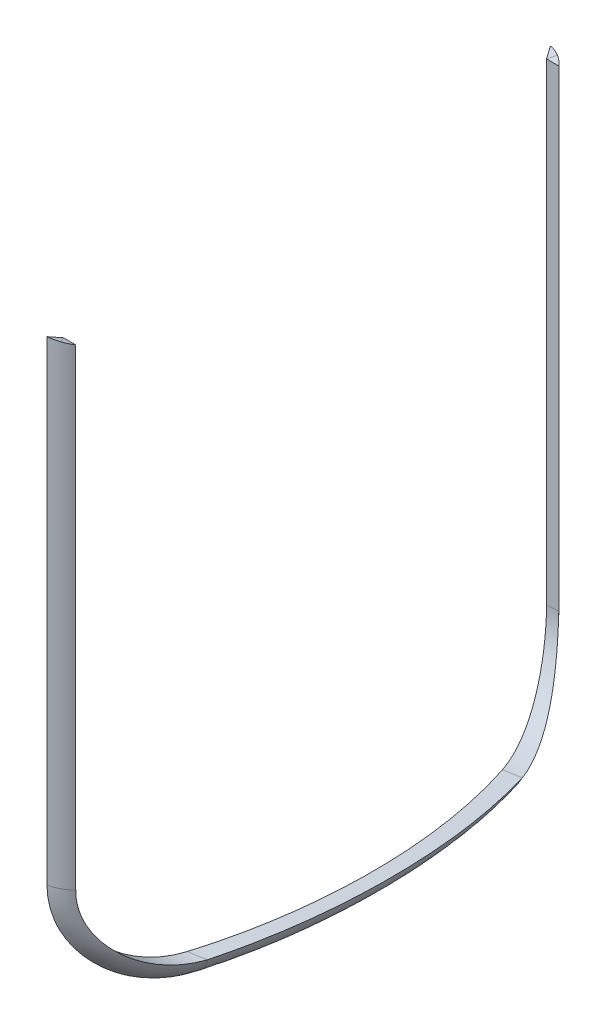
ISO-10303-21;
HEADER;
FILE_DESCRIPTION(('STEP AP214'),'2;1');
FILE_NAME('part.step','',(''),(''),'','','');
FILE_SCHEMA(('AUTOMOTIVE_DESIGN { 1 0 10303 214 1 1 1 1 }'));
ENDSEC;
DATA;
#1=APPLICATION_CONTEXT('core data for automotive mechanical design processes');
#2=APPLICATION_PROTOCOL_DEFINITION('international standard','automotive_design',2000,#1);
#3=PRODUCT_CONTEXT('',#1,'mechanical');
#4=PRODUCT('Part','Part','',(#3));
#5=PRODUCT_RELATED_PRODUCT_CATEGORY('part','',(#4));
#6=PRODUCT_DEFINITION_FORMATION('','',#4);
#7=PRODUCT_DEFINITION_CONTEXT('part definition',#1,'design');
#8=PRODUCT_DEFINITION('design','',#6,#7);
#9=PRODUCT_DEFINITION_SHAPE('','',#8);
#10=(LENGTH_UNIT() NAMED_UNIT(*) SI_UNIT(.MILLI.,.METRE.));
#11=(NAMED_UNIT(*) PLANE_ANGLE_UNIT() SI_UNIT($,.RADIAN.));
#12=(NAMED_UNIT(*) SI_UNIT($,.STERADIAN.) SOLID_ANGLE_UNIT());
#13=UNCERTAINTY_MEASURE_WITH_UNIT(LENGTH_MEASURE(1.E-05),#10,'distance_accuracy_value','');
#14=(GEOMETRIC_REPRESENTATION_CONTEXT(3) GLOBAL_UNCERTAINTY_ASSIGNED_CONTEXT((#13)) GLOBAL_UNIT_ASSIGNED_CONTEXT((#10,
#11,#12)) REPRESENTATION_CONTEXT('',''));
#15=CARTESIAN_POINT('',(0.,0.,0.));
#16=DIRECTION('',(0.,0.,1.));
#17=DIRECTION('',(1.,0.,0.));
#18=AXIS2_PLACEMENT_3D('',#15,#16,#17);
#19=CARTESIAN_POINT('',(39.2625776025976,-81.8290901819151,-23.));
#20=CARTESIAN_POINT('',(39.1328773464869,-81.8290901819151,-23.));
#21=CARTESIAN_POINT('',(38.8734768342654,-81.8290901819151,-23.));
#22=CARTESIAN_POINT('',(38.4843760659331,-81.8290901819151,-23.));
#23=CARTESIAN_POINT('',(38.2249755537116,-81.8290901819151,-23.));
#24=CARTESIAN_POINT('',(38.0952752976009,-81.8290901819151,-23.));
#25=CARTESIAN_POINT('',(39.0478339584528,-81.7534235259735,-23.2632038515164));
#26=CARTESIAN_POINT('',(38.9502824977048,-81.7585180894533,-23.2458703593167));
#27=CARTESIAN_POINT('',(38.7550361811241,-81.768663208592,-23.2111016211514));
#28=CARTESIAN_POINT('',(38.4617361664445,-81.7837459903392,-23.1586422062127));
#29=CARTESIAN_POINT('',(38.2659155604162,-81.7937093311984,-23.1234643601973));
#30=CARTESIAN_POINT('',(38.1679333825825,-81.7986675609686,-23.1058240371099));
#31=CARTESIAN_POINT('',(38.7831852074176,-81.6900234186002,-23.4837389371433));
#32=CARTESIAN_POINT('',(38.7186094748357,-81.7003435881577,-23.4486260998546));
#33=CARTESIAN_POINT('',(38.5891675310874,-81.7208947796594,-23.3781943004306));
#34=CARTESIAN_POINT('',(38.394132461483,-81.7514483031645,-23.2719261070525));
#35=CARTESIAN_POINT('',(38.2635271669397,-81.7716312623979,-23.2006655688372));
#36=CARTESIAN_POINT('',(38.1980789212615,-81.7816752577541,-23.164931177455));
#37=CARTESIAN_POINT('',(38.4769168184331,-81.6418093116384,-23.651450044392));
#38=CARTESIAN_POINT('',(38.4461760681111,-81.6574912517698,-23.5980945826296));
#39=CARTESIAN_POINT('',(38.3842531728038,-81.688719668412,-23.4910704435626));
#40=CARTESIAN_POINT('',(38.2900435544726,-81.7351470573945,-23.3295913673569));
#41=CARTESIAN_POINT('',(38.2263528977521,-81.7658159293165,-23.2213079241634));
#42=CARTESIAN_POINT('',(38.1942863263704,-81.7810782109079,-23.1670079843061));
#43=(BOUNDED_SURFACE() B_SPLINE_SURFACE(3,3,((#19,#20,#21,#22,#23,#24),(#25,#26,#27,#28,#29,
#30),(#31,#32,#33,#34,#35,#36),(#37,#38,#39,#40,#41,#42)),.UNSPECIFIED.,.F.,.F.,
.F.) B_SPLINE_SURFACE_WITH_KNOTS((4,4),(4,1,1,4),(0.,0.5),(0.,0.333333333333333,
0.666666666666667,1.),
.UNSPECIFIED.) GEOMETRIC_REPRESENTATION_ITEM() RATIONAL_B_SPLINE_SURFACE(((1.,1.,1.,1.,1.,1.),
(0.975233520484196,0.975233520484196,0.975233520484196,0.975233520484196,0.975233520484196,
0.975233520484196),(0.962850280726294,0.962850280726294,0.962850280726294,0.962850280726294,
0.962850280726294,0.962850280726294),(0.962850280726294,0.962850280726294,0.962850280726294,
0.962850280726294,0.962850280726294,0.962850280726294))) REPRESENTATION_ITEM('') SURFACE());
#44=CARTESIAN_POINT('',(39.2625776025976,-81.8290901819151,-23.));
#45=CARTESIAN_POINT('',(39.0478339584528,-81.7534235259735,-23.2632038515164));
#46=CARTESIAN_POINT('',(38.7831852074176,-81.6900234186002,-23.4837389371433));
#47=CARTESIAN_POINT('',(38.4769168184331,-81.6418093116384,-23.651450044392));
#48=(BOUNDED_CURVE() B_SPLINE_CURVE(3,(#44,#45,#46,#47),.UNSPECIFIED.,.F.,
.F.) B_SPLINE_CURVE_WITH_KNOTS((4,4),(0.,0.5),
.UNSPECIFIED.) CURVE() GEOMETRIC_REPRESENTATION_ITEM() RATIONAL_B_SPLINE_CURVE((1.,
0.975233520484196,0.962850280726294,0.962850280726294)) REPRESENTATION_ITEM(''));
#49=CARTESIAN_POINT('',(39.2625776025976,-81.8290901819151,-23.));
#50=VERTEX_POINT('',#49);
#51=CARTESIAN_POINT('',(38.4769168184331,-81.6418093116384,-23.651450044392));
#52=VERTEX_POINT('',#51);
#53=EDGE_CURVE('E241',#50,#52,#48,.T.);
#54=CARTESIAN_POINT('',(38.4769168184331,-81.6418093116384,-23.651450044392));
#55=CARTESIAN_POINT('',(38.4461760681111,-81.6574912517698,-23.5980945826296));
#56=CARTESIAN_POINT('',(38.3842531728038,-81.688719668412,-23.4910704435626));
#57=CARTESIAN_POINT('',(38.2900435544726,-81.7351470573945,-23.3295913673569));
#58=CARTESIAN_POINT('',(38.2263528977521,-81.7658159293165,-23.2213079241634));
#59=CARTESIAN_POINT('',(38.1942863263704,-81.7810782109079,-23.1670079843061));
#60=(BOUNDED_CURVE() B_SPLINE_CURVE(3,(#54,#55,#56,#57,#58,#59),.UNSPECIFIED.,.F.,
.F.) B_SPLINE_CURVE_WITH_KNOTS((4,1,1,4),(0.,0.333333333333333,0.666666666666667,1.),
.UNSPECIFIED.) CURVE() GEOMETRIC_REPRESENTATION_ITEM() RATIONAL_B_SPLINE_CURVE((0.962850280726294,
0.962850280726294,0.962850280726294,0.962850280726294,0.962850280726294,0.962850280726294)) REPRESENTATION_ITEM(''));
#61=CARTESIAN_POINT('',(38.1942863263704,-81.7810782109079,-23.1670079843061));
#62=VERTEX_POINT('',#61);
#63=EDGE_CURVE('E440',#52,#62,#60,.T.);
#64=CARTESIAN_POINT('',(38.1942863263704,-81.7810782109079,-23.1670079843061));
#65=CARTESIAN_POINT('',(38.1980789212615,-81.7816752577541,-23.164931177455));
#66=CARTESIAN_POINT('',(38.1679333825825,-81.7986675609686,-23.1058240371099));
#67=CARTESIAN_POINT('',(38.0952752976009,-81.8290901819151,-23.));
#68=(BOUNDED_CURVE() B_SPLINE_CURVE(3,(#64,#65,#66,#67),.UNSPECIFIED.,.F.,
.F.) B_SPLINE_CURVE_WITH_KNOTS((4,4),(0.,0.5),
.UNSPECIFIED.) CURVE() GEOMETRIC_REPRESENTATION_ITEM() RATIONAL_B_SPLINE_CURVE((0.962850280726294,
0.962850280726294,0.975233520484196,1.)) REPRESENTATION_ITEM(''));
#69=CARTESIAN_POINT('',(38.0952752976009,-81.8290901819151,-23.));
#70=VERTEX_POINT('',#69);
#71=EDGE_CURVE('E523',#62,#70,#68,.T.);
#72=DIRECTION('',(1.,0.,0.));
#73=VECTOR('',#72,1.);
#74=CARTESIAN_POINT('',(34.5,-81.8290901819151,-23.));
#75=LINE('',#74,#73);
#76=EDGE_CURVE('E522',#70,#50,#75,.T.);
#77=ORIENTED_EDGE('',*,*,#53,.T.);
#78=ORIENTED_EDGE('',*,*,#63,.T.);
#79=ORIENTED_EDGE('',*,*,#71,.T.);
#80=ORIENTED_EDGE('',*,*,#76,.T.);
#81=EDGE_LOOP('',(#77,#78,#79,#80));
#82=FACE_BOUND('',#81,.T.);
#83=ADVANCED_FACE('F110',(#82),#43,.T.);
#84=CARTESIAN_POINT('',(38.4769168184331,-81.6418093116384,-23.651450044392));
#85=CARTESIAN_POINT('',(38.4461760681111,-81.6574912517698,-23.5980945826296));
#86=CARTESIAN_POINT('',(38.3842531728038,-81.688719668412,-23.4910704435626));
#87=CARTESIAN_POINT('',(38.2900435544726,-81.7351470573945,-23.3295913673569));
#88=CARTESIAN_POINT('',(38.2263528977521,-81.7658159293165,-23.2213079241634));
#89=CARTESIAN_POINT('',(38.1942863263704,-81.7810782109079,-23.1670079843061));
#90=CARTESIAN_POINT('',(38.1706484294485,-81.5935952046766,-23.8191611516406));
#91=CARTESIAN_POINT('',(38.1737426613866,-81.6146389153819,-23.7475630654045));
#92=CARTESIAN_POINT('',(38.1793388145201,-81.6565445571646,-23.6039465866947));
#93=CARTESIAN_POINT('',(38.1859546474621,-81.7188458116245,-23.3872566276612));
#94=CARTESIAN_POINT('',(38.1891786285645,-81.7600005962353,-23.2419502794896));
#95=CARTESIAN_POINT('',(38.1904937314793,-81.7804811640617,-23.1690847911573));
#96=CARTESIAN_POINT('',(37.8383160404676,-81.5630159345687,-23.9255300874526));
#97=CARTESIAN_POINT('',(37.8743860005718,-81.5892852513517,-23.8361526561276));
#98=CARTESIAN_POINT('',(37.9457865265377,-81.6415969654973,-23.656873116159));
#99=CARTESIAN_POINT('',(38.0506673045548,-81.7193689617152,-23.3863743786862));
#100=CARTESIAN_POINT('',(38.1191065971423,-81.7707433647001,-23.2049853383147));
#101=CARTESIAN_POINT('',(38.1529556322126,-81.7963096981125,-23.1140257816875));
#102=CARTESIAN_POINT('',(37.4932339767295,-81.5505523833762,-23.9688841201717));
#103=CARTESIAN_POINT('',(37.5614527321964,-81.581916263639,-23.8621731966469));
#104=CARTESIAN_POINT('',(37.6970074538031,-81.6443730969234,-23.648124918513));
#105=CARTESIAN_POINT('',(37.897688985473,-81.7372278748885,-23.3251667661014));
#106=CARTESIAN_POINT('',(38.0297081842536,-81.7985656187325,-23.1085998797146));
#107=CARTESIAN_POINT('',(38.0952752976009,-81.8290901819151,-23.));
#108=CARTESIAN_POINT('',(37.4898686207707,-81.5504308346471,-23.9693069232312));
#109=CARTESIAN_POINT('',(37.5584009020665,-81.5818443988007,-23.8624269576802));
#110=CARTESIAN_POINT('',(37.6945812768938,-81.6444001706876,-23.6480396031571));
#111=CARTESIAN_POINT('',(37.8961970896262,-81.7374020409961,-23.3245698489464));
#112=CARTESIAN_POINT('',(38.0288363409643,-81.79883695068,-23.1076598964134));
#113=CARTESIAN_POINT('',(38.094712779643,-81.8294098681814,-22.998887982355));
#114=CARTESIAN_POINT('',(37.486503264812,-81.550309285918,-23.9697297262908));
#115=CARTESIAN_POINT('',(37.5553490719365,-81.5817725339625,-23.8626807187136));
#116=CARTESIAN_POINT('',(37.6921550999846,-81.6444272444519,-23.6479542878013));
#117=CARTESIAN_POINT('',(37.8947051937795,-81.7375762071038,-23.3239729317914));
#118=CARTESIAN_POINT('',(38.027964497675,-81.7991082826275,-23.1067199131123));
#119=CARTESIAN_POINT('',(38.0941502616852,-81.8297295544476,-22.99777596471));
#120=CARTESIAN_POINT('',(37.4831379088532,-81.550187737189,-23.9701525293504));
#121=CARTESIAN_POINT('',(37.5522972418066,-81.5817006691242,-23.8629344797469));
#122=CARTESIAN_POINT('',(37.6897289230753,-81.6444543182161,-23.6478689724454));
#123=CARTESIAN_POINT('',(37.8932132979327,-81.7377503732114,-23.3233760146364));
#124=CARTESIAN_POINT('',(38.0270926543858,-81.7993796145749,-23.1057799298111));
#125=CARTESIAN_POINT('',(38.0935877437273,-81.8300492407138,-22.996663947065));
#126=(BOUNDED_SURFACE() B_SPLINE_SURFACE(3,3,((#84,#85,#86,#87,#88,#89),(#90,#91,#92,#93,#94,
#95),(#96,#97,#98,#99,#100,#101),(#102,#103,#104,#105,#106,#107),(#108,#109,#110,#111,#112,
#113),(#114,#115,#116,#117,#118,#119),(#120,#121,#122,#123,#124,#125)),.UNSPECIFIED.,.F.,.F.,
.F.) B_SPLINE_SURFACE_WITH_KNOTS((4,3,4),(4,1,1,4),(0.5,1.,1.005),(0.,0.333333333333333,
0.666666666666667,1.),
.UNSPECIFIED.) GEOMETRIC_REPRESENTATION_ITEM() RATIONAL_B_SPLINE_SURFACE(((0.962850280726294,
0.962850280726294,0.962850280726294,0.962850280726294,0.962850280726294,0.962850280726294),
(0.962850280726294,0.962850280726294,0.962850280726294,0.962850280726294,0.962850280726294,
0.962850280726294),(0.975233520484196,0.975233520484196,0.975233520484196,0.975233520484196,
0.975233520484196,0.975233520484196),(1.,1.,1.,1.,1.,1.),(1.,1.,1.,1.,1.,1.),(1.,1.,1.,1.,1.,
1.),(1.,1.,1.,1.,1.,1.))) REPRESENTATION_ITEM('') SURFACE());
#127=CARTESIAN_POINT('',(38.4769168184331,-81.6418093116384,-23.651450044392));
#128=CARTESIAN_POINT('',(38.1706484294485,-81.5935952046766,-23.8191611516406));
#129=CARTESIAN_POINT('',(37.8383160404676,-81.5630159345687,-23.9255300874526));
#130=CARTESIAN_POINT('',(37.4932339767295,-81.5505523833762,-23.9688841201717));
#131=(BOUNDED_CURVE() B_SPLINE_CURVE(3,(#127,#128,#129,#130),.UNSPECIFIED.,.F.,
.F.) B_SPLINE_CURVE_WITH_KNOTS((4,4),(0.5,1.),
.UNSPECIFIED.) CURVE() GEOMETRIC_REPRESENTATION_ITEM() RATIONAL_B_SPLINE_CURVE((0.962850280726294,
0.962850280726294,0.975233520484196,1.)) REPRESENTATION_ITEM(''));
#132=CARTESIAN_POINT('',(37.4932339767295,-81.5505523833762,-23.9688841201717));
#133=VERTEX_POINT('',#132);
#134=EDGE_CURVE('E132',#52,#133,#131,.T.);
#135=CARTESIAN_POINT('',(37.4932339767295,-81.5505523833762,-23.9688841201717));
#136=CARTESIAN_POINT('',(37.5955485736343,-81.5975920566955,-23.8088389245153));
#137=CARTESIAN_POINT('',(37.6968778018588,-81.6443304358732,-23.6480769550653));
#138=CARTESIAN_POINT('',(37.847387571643,-81.7139692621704,-23.4058601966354));
#139=CARTESIAN_POINT('',(37.8973138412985,-81.7371057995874,-23.3249361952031));
#140=CARTESIAN_POINT('',(37.9966688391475,-81.7832189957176,-23.1627330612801));
#141=CARTESIAN_POINT('',(38.0460975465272,-81.8061956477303,-23.0814539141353));
#142=CARTESIAN_POINT('',(38.0952752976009,-81.8290901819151,-23.));
#143=B_SPLINE_CURVE_WITH_KNOTS('',3,(#135,#136,#137,#138,#139,#140,#141,#142),.UNSPECIFIED.,.F.,
.F.,(4,2,2,4),(0.,0.587069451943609,0.880648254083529,1.1742392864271),.UNSPECIFIED.);
#144=EDGE_CURVE('E251',#133,#70,#143,.T.);
#145=ORIENTED_EDGE('',*,*,#134,.T.);
#146=ORIENTED_EDGE('',*,*,#144,.T.);
#147=ORIENTED_EDGE('',*,*,#71,.F.);
#148=ORIENTED_EDGE('',*,*,#63,.F.);
#149=EDGE_LOOP('',(#145,#146,#147,#148));
#150=FACE_BOUND('',#149,.T.);
#151=ADVANCED_FACE('F112',(#150),#126,.T.);
#152=CARTESIAN_POINT('',(39.2625776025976,-81.8290901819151,23.));
#153=CARTESIAN_POINT('',(39.1328773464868,-81.8290901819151,23.));
#154=CARTESIAN_POINT('',(38.8734768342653,-81.8290901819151,23.));
#155=CARTESIAN_POINT('',(38.4843760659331,-81.8290901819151,23.));
#156=CARTESIAN_POINT('',(38.2249755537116,-81.8290901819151,23.));
#157=CARTESIAN_POINT('',(38.0952752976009,-81.8290901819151,23.));
#158=CARTESIAN_POINT('',(39.0478339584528,-81.7534235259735,23.2632038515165));
#159=CARTESIAN_POINT('',(38.9503026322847,-81.7585273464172,23.2458388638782));
#160=CARTESIAN_POINT('',(38.755082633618,-81.7686846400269,23.2110277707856));
#161=CARTESIAN_POINT('',(38.4617818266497,-81.783767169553,23.158567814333));
#162=CARTESIAN_POINT('',(38.2659349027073,-81.7937183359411,23.1234323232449));
#163=CARTESIAN_POINT('',(38.1679333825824,-81.7986675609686,23.10582403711));
#164=CARTESIAN_POINT('',(38.7831852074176,-81.6900234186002,23.4837389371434));
#165=CARTESIAN_POINT('',(38.7186502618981,-81.7003623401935,23.4485622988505));
#166=CARTESIAN_POINT('',(38.5892616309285,-81.7209381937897,23.3780447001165));
#167=CARTESIAN_POINT('',(38.3942249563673,-81.7514912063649,23.2717754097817));
#168=CARTESIAN_POINT('',(38.2635663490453,-81.7716495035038,23.2006006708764));
#169=CARTESIAN_POINT('',(38.1980789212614,-81.7816752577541,23.164931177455));
#170=CARTESIAN_POINT('',(38.476916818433,-81.6418093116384,23.651450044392));
#171=CARTESIAN_POINT('',(38.4462380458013,-81.6575197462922,23.5979976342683));
#172=CARTESIAN_POINT('',(38.384396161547,-81.6887856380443,23.4908431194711));
#173=CARTESIAN_POINT('',(38.2901841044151,-81.735212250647,23.3293623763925));
#174=CARTESIAN_POINT('',(38.2264124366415,-81.7658436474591,23.2212093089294));
#175=CARTESIAN_POINT('',(38.1942863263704,-81.7810782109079,23.1670079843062));
#176=(BOUNDED_SURFACE() B_SPLINE_SURFACE(3,3,((#152,#153,#154,#155,#156,#157),(#158,#159,#160,
#161,#162,#163),(#164,#165,#166,#167,#168,#169),(#170,#171,#172,#173,#174,#175)),.UNSPECIFIED.,
.F.,.F.,.F.) B_SPLINE_SURFACE_WITH_KNOTS((4,4),(4,1,1,4),(0.,0.5),(0.,0.333333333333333,
0.666666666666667,1.),
.UNSPECIFIED.) GEOMETRIC_REPRESENTATION_ITEM() RATIONAL_B_SPLINE_SURFACE(((1.,1.,1.,1.,1.,1.),
(0.975233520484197,0.975233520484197,0.975233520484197,0.975233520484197,0.975233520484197,
0.975233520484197),(0.962850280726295,0.962850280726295,0.962850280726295,0.962850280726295,
0.962850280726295,0.962850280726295),(0.962850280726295,0.962850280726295,0.962850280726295,
0.962850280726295,0.962850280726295,0.962850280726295))) REPRESENTATION_ITEM('') SURFACE());
#177=CARTESIAN_POINT('',(37.1443222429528,-82.2880049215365,21.4036809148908));
#178=DIRECTION('',(0.,-0.961073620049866,0.276292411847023));
#179=DIRECTION('',(0.,-0.276292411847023,-0.961073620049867));
#180=AXIS2_PLACEMENT_3D('',#177,#178,#179);
#181=CIRCLE('',#180,2.69181038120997);
#182=CARTESIAN_POINT('',(39.2625776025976,-81.8290901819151,23.));
#183=VERTEX_POINT('',#182);
#184=CARTESIAN_POINT('',(38.476916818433,-81.6418093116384,23.651450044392));
#185=VERTEX_POINT('',#184);
#186=EDGE_CURVE('E210',#183,#185,#181,.T.);
#187=CARTESIAN_POINT('',(38.0952752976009,-81.8290901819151,23.));
#188=CARTESIAN_POINT('',(38.289825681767,-81.8290901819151,23.));
#189=CARTESIAN_POINT('',(38.4843760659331,-81.8290901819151,23.));
#190=CARTESIAN_POINT('',(38.8734768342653,-81.8290901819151,23.));
#191=CARTESIAN_POINT('',(39.0680272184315,-81.8290901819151,23.));
#192=CARTESIAN_POINT('',(39.2625776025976,-81.8290901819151,23.));
#193=B_SPLINE_CURVE_WITH_KNOTS('',3,(#187,#188,#189,#190,#191,#192),.UNSPECIFIED.,.F.,.F.,(4,2,
4),(0.,0.583651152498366,1.16730230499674),.UNSPECIFIED.);
#194=CARTESIAN_POINT('',(38.0952752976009,-81.8290901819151,23.));
#195=VERTEX_POINT('',#194);
#196=EDGE_CURVE('E196',#195,#183,#193,.T.);
#197=CARTESIAN_POINT('',(38.1942863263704,-81.7810782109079,23.1670079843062));
#198=CARTESIAN_POINT('',(38.1904937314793,-81.7804811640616,23.1690847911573));
#199=CARTESIAN_POINT('',(38.1529556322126,-81.7963096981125,23.1140257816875));
#200=CARTESIAN_POINT('',(38.0952752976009,-81.8290901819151,23.));
#201=CARTESIAN_POINT('',(38.094712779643,-81.8294098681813,22.998887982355));
#202=CARTESIAN_POINT('',(38.0941502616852,-81.8297295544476,22.99777596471));
#203=CARTESIAN_POINT('',(38.0935877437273,-81.8300492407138,22.996663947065));
#204=(BOUNDED_CURVE() B_SPLINE_CURVE(3,(#197,#198,#199,#200,#201,#202,#203),.UNSPECIFIED.,.F.,
.F.) B_SPLINE_CURVE_WITH_KNOTS((4,3,4),(0.5,1.,1.005),
.UNSPECIFIED.) CURVE() GEOMETRIC_REPRESENTATION_ITEM() RATIONAL_B_SPLINE_CURVE((0.962850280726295,
0.962850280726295,0.975233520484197,1.,1.,1.,1.)) REPRESENTATION_ITEM(''));
#205=CARTESIAN_POINT('',(38.1942863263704,-81.7810782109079,23.1670079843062));
#206=VERTEX_POINT('',#205);
#207=EDGE_CURVE('E506',#206,#195,#204,.T.);
#208=CARTESIAN_POINT('',(38.476916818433,-81.6418093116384,23.651450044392));
#209=CARTESIAN_POINT('',(38.4653985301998,-81.6477077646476,23.6313814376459));
#210=CARTESIAN_POINT('',(38.4538598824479,-81.6535882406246,23.6113192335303));
#211=CARTESIAN_POINT('',(38.430714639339,-81.6653273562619,23.5711596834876));
#212=CARTESIAN_POINT('',(38.4191079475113,-81.6711859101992,23.5510623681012));
#213=CARTESIAN_POINT('',(38.3958266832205,-81.6828810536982,23.5108325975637));
#214=CARTESIAN_POINT('',(38.384152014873,-81.6887175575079,23.4907001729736));
#215=CARTESIAN_POINT('',(38.3607348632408,-81.7003684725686,23.4504001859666));
#216=CARTESIAN_POINT('',(38.3489922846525,-81.7061827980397,23.4302326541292));
#217=CARTESIAN_POINT('',(38.3254393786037,-81.7177892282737,23.3898624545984));
#218=CARTESIAN_POINT('',(38.313628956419,-81.723581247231,23.369659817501));
#219=CARTESIAN_POINT('',(38.2899404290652,-81.7351429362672,23.3292194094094));
#220=CARTESIAN_POINT('',(38.2780622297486,-81.7409125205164,23.3089816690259));
#221=CARTESIAN_POINT('',(38.2542382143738,-81.7524292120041,23.268471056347));
#222=CARTESIAN_POINT('',(38.2422923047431,-81.7581762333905,23.2481982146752));
#223=CARTESIAN_POINT('',(38.218332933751,-81.7696476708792,23.2076174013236));
#224=CARTESIAN_POINT('',(38.2063193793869,-81.7753720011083,23.1873094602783));
#225=CARTESIAN_POINT('',(38.1942863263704,-81.7810782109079,23.1670079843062));
#226=B_SPLINE_CURVE_WITH_KNOTS('',3,(#208,#209,#210,#211,#212,#213,#214,#215,#216,#217,#218,
#219,#220,#221,#222,#223,#224,#225),.UNSPECIFIED.,.F.,.F.,(4,2,2,2,2,2,2,2,4),(0.,
0.0716372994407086,0.143445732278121,0.215425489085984,0.287576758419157,0.359899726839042,
0.432394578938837,0.505061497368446,0.577900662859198),.UNSPECIFIED.);
#227=EDGE_CURVE('E218',#185,#206,#226,.T.);
#228=ORIENTED_EDGE('',*,*,#186,.F.);
#229=ORIENTED_EDGE('',*,*,#196,.F.);
#230=ORIENTED_EDGE('',*,*,#207,.F.);
#231=ORIENTED_EDGE('',*,*,#227,.F.);
#232=EDGE_LOOP('',(#228,#229,#230,#231));
#233=FACE_BOUND('',#232,.T.);
#234=ADVANCED_FACE('F216',(#233),#176,.F.);
#235=CARTESIAN_POINT('',(38.476916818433,-81.6418093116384,23.651450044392));
#236=CARTESIAN_POINT('',(38.4462380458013,-81.6575197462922,23.5979976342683));
#237=CARTESIAN_POINT('',(38.384396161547,-81.6887856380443,23.4908431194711));
#238=CARTESIAN_POINT('',(38.2901841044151,-81.735212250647,23.3293623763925));
#239=CARTESIAN_POINT('',(38.2264124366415,-81.7658436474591,23.2212093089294));
#240=CARTESIAN_POINT('',(38.1942863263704,-81.7810782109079,23.1670079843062));
#241=CARTESIAN_POINT('',(38.1706484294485,-81.5935952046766,23.8191611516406));
#242=CARTESIAN_POINT('',(38.1738258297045,-81.6146771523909,23.747432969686));
#243=CARTESIAN_POINT('',(38.1795306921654,-81.656633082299,23.6036415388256));
#244=CARTESIAN_POINT('',(38.1861432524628,-81.7189332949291,23.3869493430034));
#245=CARTESIAN_POINT('',(38.1892585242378,-81.7600377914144,23.2418179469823));
#246=CARTESIAN_POINT('',(38.1904937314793,-81.7804811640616,23.1690847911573));
#247=CARTESIAN_POINT('',(37.8383160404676,-81.5630159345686,23.9255300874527));
#248=CARTESIAN_POINT('',(37.8744898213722,-81.5893329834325,23.8359902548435));
#249=CARTESIAN_POINT('',(37.9460260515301,-81.641707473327,23.6564923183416));
#250=CARTESIAN_POINT('',(38.0509027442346,-81.7194781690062,23.3859907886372));
#251=CARTESIAN_POINT('',(38.11920633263,-81.7707897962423,23.204820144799));
#252=CARTESIAN_POINT('',(38.1529556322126,-81.7963096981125,23.1140257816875));
#253=CARTESIAN_POINT('',(37.4932339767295,-81.5505523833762,23.9688841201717));
#254=CARTESIAN_POINT('',(37.5615766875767,-81.5819732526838,23.8619792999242));
#255=CARTESIAN_POINT('',(37.6972934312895,-81.644505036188,23.6476702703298));
#256=CARTESIAN_POINT('',(37.897970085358,-81.7373582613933,23.3247087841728));
#257=CARTESIAN_POINT('',(38.0298272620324,-81.7986210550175,23.1084026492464));
#258=CARTESIAN_POINT('',(38.0952752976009,-81.8290901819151,23.));
#259=CARTESIAN_POINT('',(37.4898686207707,-81.5504308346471,23.9693069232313));
#260=CARTESIAN_POINT('',(37.5585250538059,-81.5819014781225,23.8622327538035));
#261=CARTESIAN_POINT('',(37.6948677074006,-81.6445323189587,23.6475842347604));
#262=CARTESIAN_POINT('',(37.8964786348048,-81.7375326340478,23.3241111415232));
#263=CARTESIAN_POINT('',(38.0289556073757,-81.7988924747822,23.1074623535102));
#264=CARTESIAN_POINT('',(38.094712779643,-81.8294098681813,22.998887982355));
#265=CARTESIAN_POINT('',(37.486503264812,-81.550309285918,23.9697297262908));
#266=CARTESIAN_POINT('',(37.5554734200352,-81.5818297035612,23.8624862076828));
#267=CARTESIAN_POINT('',(37.6924419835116,-81.6445596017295,23.647498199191));
#268=CARTESIAN_POINT('',(37.8949871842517,-81.7377070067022,23.3235134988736));
#269=CARTESIAN_POINT('',(38.0280839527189,-81.799163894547,23.106522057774));
#270=CARTESIAN_POINT('',(38.0941502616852,-81.8297295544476,22.99777596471));
#271=CARTESIAN_POINT('',(37.4831379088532,-81.550187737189,23.9701525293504));
#272=CARTESIAN_POINT('',(37.5524217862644,-81.5817579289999,23.8627396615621));
#273=CARTESIAN_POINT('',(37.6900162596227,-81.6445868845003,23.6474121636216));
#274=CARTESIAN_POINT('',(37.8934957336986,-81.7378813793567,23.3229158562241));
#275=CARTESIAN_POINT('',(38.0272122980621,-81.7994353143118,23.1055817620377));
#276=CARTESIAN_POINT('',(38.0935877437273,-81.8300492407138,22.996663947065));
#277=(BOUNDED_SURFACE() B_SPLINE_SURFACE(3,3,((#235,#236,#237,#238,#239,#240),(#241,#242,#243,
#244,#245,#246),(#247,#248,#249,#250,#251,#252),(#253,#254,#255,#256,#257,#258),(#259,#260,#261,
#262,#263,#264),(#265,#266,#267,#268,#269,#270),(#271,#272,#273,#274,#275,#276)),.UNSPECIFIED.,
.F.,.F.,.F.) B_SPLINE_SURFACE_WITH_KNOTS((4,3,4),(4,1,1,4),(0.5,1.,1.005),(0.,0.333333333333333,
0.666666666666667,1.),
.UNSPECIFIED.) GEOMETRIC_REPRESENTATION_ITEM() RATIONAL_B_SPLINE_SURFACE(((0.962850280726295,
0.962850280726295,0.962850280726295,0.962850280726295,0.962850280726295,0.962850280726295),
(0.962850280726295,0.962850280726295,0.962850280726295,0.962850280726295,0.962850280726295,
0.962850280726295),(0.975233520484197,0.975233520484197,0.975233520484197,0.975233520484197,
0.975233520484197,0.975233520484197),(1.,1.,1.,1.,1.,1.),(1.,1.,1.,1.,1.,1.),(1.,1.,1.,1.,1.,
1.),(1.,1.,1.,1.,1.,1.))) REPRESENTATION_ITEM('') SURFACE());
#278=CARTESIAN_POINT('',(37.1443222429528,-82.2880049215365,21.4036809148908));
#279=DIRECTION('',(0.,-0.961073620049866,0.276292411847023));
#280=DIRECTION('',(0.,-0.276292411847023,-0.961073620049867));
#281=AXIS2_PLACEMENT_3D('',#278,#279,#280);
#282=CIRCLE('',#281,2.69181038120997);
#283=CARTESIAN_POINT('',(37.4932339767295,-81.5505523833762,23.9688841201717));
#284=VERTEX_POINT('',#283);
#285=EDGE_CURVE('E221',#185,#284,#282,.T.);
#286=CARTESIAN_POINT('',(37.4932339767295,-81.5505523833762,23.9688841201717));
#287=CARTESIAN_POINT('',(37.5955485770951,-81.5975920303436,23.8088389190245));
#288=CARTESIAN_POINT('',(37.6968778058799,-81.6443304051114,23.648076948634));
#289=CARTESIAN_POINT('',(37.8473875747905,-81.7139692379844,23.4058601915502));
#290=CARTESIAN_POINT('',(37.8973138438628,-81.7371057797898,23.3249361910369));
#291=CARTESIAN_POINT('',(37.9966688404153,-81.7832189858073,23.1627330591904));
#292=CARTESIAN_POINT('',(38.0460975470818,-81.8061956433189,23.0814539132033));
#293=CARTESIAN_POINT('',(38.0952752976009,-81.8290901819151,23.));
#294=B_SPLINE_CURVE_WITH_KNOTS('',3,(#286,#287,#288,#289,#290,#291,#292,#293),.UNSPECIFIED.,.F.,
.F.,(4,2,2,4),(0.,0.587069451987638,0.880648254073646,1.17423928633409),.UNSPECIFIED.);
#295=EDGE_CURVE('E205',#284,#195,#294,.T.);
#296=ORIENTED_EDGE('',*,*,#285,.F.);
#297=ORIENTED_EDGE('',*,*,#227,.T.);
#298=ORIENTED_EDGE('',*,*,#207,.T.);
#299=ORIENTED_EDGE('',*,*,#295,.F.);
#300=EDGE_LOOP('',(#296,#297,#298,#299));
#301=FACE_BOUND('',#300,.T.);
#302=ADVANCED_FACE('F413',(#301),#277,.F.);
#303=CARTESIAN_POINT('',(34.5,-75.,-23.));
#304=DIRECTION('',(0.,0.,1.));
#305=DIRECTION('',(1.,0.,0.));
#306=AXIS2_PLACEMENT_3D('',#303,#304,#305);
#307=PLANE('',#306);
#308=DIRECTION('',(0.,1.,0.));
#309=VECTOR('',#308,1.);
#310=CARTESIAN_POINT('',(39.2625776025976,-75.,-23.));
#311=LINE('',#310,#309);
#312=CARTESIAN_POINT('',(39.2625776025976,-126.781443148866,-23.));
#313=VERTEX_POINT('',#312);
#314=EDGE_CURVE('E331',#50,#313,#311,.F.);
#315=ORIENTED_EDGE('',*,*,#314,.F.);
#316=ORIENTED_EDGE('',*,*,#76,.F.);
#317=DIRECTION('',(0.,1.,0.));
#318=VECTOR('',#317,1.);
#319=CARTESIAN_POINT('',(38.0952752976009,-135.,-23.));
#320=LINE('',#319,#318);
#321=CARTESIAN_POINT('',(38.0952752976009,-126.87556260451,-23.));
#322=VERTEX_POINT('',#321);
#323=EDGE_CURVE('E261',#322,#70,#320,.T.);
#324=ORIENTED_EDGE('',*,*,#323,.F.);
#325=CARTESIAN_POINT('',(34.5,-75.,-23.));
#326=DIRECTION('',(0.,0.,1.));
#327=DIRECTION('',(1.,0.,0.));
#328=AXIS2_PLACEMENT_3D('',#325,#326,#327);
#329=CIRCLE('',#328,52.);
#330=EDGE_CURVE('E534',#313,#322,#329,.F.);
#331=ORIENTED_EDGE('',*,*,#330,.F.);
#332=EDGE_LOOP('',(#315,#316,#324,#331));
#333=FACE_BOUND('',#332,.T.);
#334=ADVANCED_FACE('F342',(#333),#307,.T.);
#335=CARTESIAN_POINT('',(34.5,-75.,-15.));
#336=DIRECTION('',(0.,0.,1.));
#337=DIRECTION('',(1.,0.,0.));
#338=AXIS2_PLACEMENT_3D('',#335,#336,#337);
#339=TOROIDAL_SURFACE('',#338,52.,8.);
#340=CARTESIAN_POINT('',(39.2625776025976,-126.781443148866,-23.));
#341=CARTESIAN_POINT('',(39.2604899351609,-126.869347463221,-23.0000007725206));
#342=CARTESIAN_POINT('',(39.2595740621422,-126.957269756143,-22.9985692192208));
#343=CARTESIAN_POINT('',(39.2600894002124,-127.133012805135,-22.9928253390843));
#344=CARTESIAN_POINT('',(39.2615206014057,-127.220833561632,-22.9885130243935));
#345=CARTESIAN_POINT('',(39.2693373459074,-127.483847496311,-22.9712367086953));
#346=CARTESIAN_POINT('',(39.2792438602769,-127.658683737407,-22.9539333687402));
#347=CARTESIAN_POINT('',(39.3081025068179,-128.005210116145,-22.907926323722));
#348=CARTESIAN_POINT('',(39.3270111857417,-128.176911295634,-22.8792774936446));
#349=CARTESIAN_POINT('',(39.3734166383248,-128.516896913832,-22.8108095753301));
#350=CARTESIAN_POINT('',(39.4009137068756,-128.685181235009,-22.770990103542));
#351=CARTESIAN_POINT('',(39.4642135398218,-129.018433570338,-22.6802357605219));
#352=CARTESIAN_POINT('',(39.5000734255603,-129.183369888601,-22.6292245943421));
#353=CARTESIAN_POINT('',(39.5793853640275,-129.507749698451,-22.5167459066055));
#354=CARTESIAN_POINT('',(39.6228374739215,-129.667193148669,-22.4552783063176));
#355=CARTESIAN_POINT('',(39.7166480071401,-129.979952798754,-22.3223876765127));
#356=CARTESIAN_POINT('',(39.7670129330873,-130.133263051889,-22.2509552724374));
#357=CARTESIAN_POINT('',(39.8737217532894,-130.433008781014,-22.0987635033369));
#358=CARTESIAN_POINT('',(39.9300659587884,-130.579443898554,-22.0180036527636));
#359=CARTESIAN_POINT('',(40.0534587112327,-130.878105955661,-21.8398979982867));
#360=CARTESIAN_POINT('',(40.1210152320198,-131.029621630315,-21.741709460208));
#361=CARTESIAN_POINT('',(40.261421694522,-131.323312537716,-21.5357204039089));
#362=CARTESIAN_POINT('',(40.3342718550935,-131.465487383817,-21.4279194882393));
#363=CARTESIAN_POINT('',(40.5594566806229,-131.877554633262,-21.0910654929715));
#364=CARTESIAN_POINT('',(40.7184595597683,-132.133069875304,-20.8485129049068));
#365=CARTESIAN_POINT('',(40.9778419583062,-132.504845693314,-20.4410217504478));
#366=CARTESIAN_POINT('',(41.0749458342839,-132.634671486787,-20.2860179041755));
#367=CARTESIAN_POINT('',(41.2715617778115,-132.880279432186,-19.9666723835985));
#368=CARTESIAN_POINT('',(41.3710740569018,-132.99606034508,-19.8023298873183));
#369=CARTESIAN_POINT('',(41.6718052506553,-133.3220280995,-19.2963834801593));
#370=CARTESIAN_POINT('',(41.8752034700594,-133.510818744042,-18.9418840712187));
#371=CARTESIAN_POINT('',(42.1913292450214,-133.759446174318,-18.3671158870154));
#372=CARTESIAN_POINT('',(42.3049104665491,-133.839612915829,-18.1557388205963));
#373=CARTESIAN_POINT('',(42.530442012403,-133.980799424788,-17.7257077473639));
#374=CARTESIAN_POINT('',(42.6423920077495,-134.041815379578,-17.5070523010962));
#375=CARTESIAN_POINT('',(42.8633877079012,-134.14427894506,-17.0640979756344));
#376=CARTESIAN_POINT('',(42.9724367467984,-134.185750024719,-16.8398062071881));
#377=CARTESIAN_POINT('',(43.1331886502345,-134.233137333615,-16.5000909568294));
#378=CARTESIAN_POINT('',(43.1862968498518,-134.246462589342,-16.3863185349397));
#379=CARTESIAN_POINT('',(43.2914083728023,-134.268162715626,-16.1578005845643));
#380=CARTESIAN_POINT('',(43.343411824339,-134.276538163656,-16.0430551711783));
#381=CARTESIAN_POINT('',(43.4292731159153,-134.286327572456,-15.8510652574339));
#382=CARTESIAN_POINT('',(43.4634229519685,-134.289129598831,-15.7740189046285));
#383=CARTESIAN_POINT('',(43.5143198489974,-134.291642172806,-15.658278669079));
#384=CARTESIAN_POINT('',(43.5312293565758,-134.292197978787,-15.6196735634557));
#385=CARTESIAN_POINT('',(43.5648813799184,-134.292755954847,-15.5423861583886));
#386=CARTESIAN_POINT('',(43.5816238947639,-134.292758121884,-15.5037038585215));
#387=CARTESIAN_POINT('',(43.6148630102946,-134.292216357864,-15.4263094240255));
#388=CARTESIAN_POINT('',(43.6313599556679,-134.291673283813,-15.3875974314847));
#389=CARTESIAN_POINT('',(43.664127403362,-134.290040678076,-15.3100892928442));
#390=CARTESIAN_POINT('',(43.6803979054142,-134.288951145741,-15.2712931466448));
#391=CARTESIAN_POINT('',(43.7128978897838,-134.286192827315,-15.1936949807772));
#392=CARTESIAN_POINT('',(43.729127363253,-134.284523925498,-15.1548929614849));
#393=CARTESIAN_POINT('',(43.7617015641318,-134.28058324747,-15.0773678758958));
#394=CARTESIAN_POINT('',(43.7780462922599,-134.278311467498,-15.0386448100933));
#395=CARTESIAN_POINT('',(43.7945283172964,-134.275726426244,-15.));
#396=B_SPLINE_CURVE_WITH_KNOTS('',3,(#340,#341,#342,#343,#344,#345,#346,#347,#348,#349,#350,
#351,#352,#353,#354,#355,#356,#357,#358,#359,#360,#361,#362,#363,#364,#365,#366,#367,#368,#369,
#370,#371,#372,#373,#374,#375,#376,#377,#378,#379,#380,#381,#382,#383,#384,#385,#386,#387,#388,
#389,#390,#391,#392,#393,#394,#395),.UNSPECIFIED.,.F.,.F.,(4,2,2,2,2,2,2,2,2,2,2,2,2,2,2,2,2,2,
2,2,2,2,2,2,2,2,2,4),(0.,0.263747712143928,0.527494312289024,1.05471413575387,1.57941449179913,
2.10413286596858,2.63254605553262,3.16096322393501,3.68988090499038,4.21882613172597,
4.79655131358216,5.37430039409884,6.52950286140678,7.2018526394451,7.87426168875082,
9.2191837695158,9.97750960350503,10.7359863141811,11.4935499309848,11.8722512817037,
12.2509084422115,12.5038440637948,12.6302894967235,12.7567356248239,12.8829833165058,
13.0092311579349,13.1355042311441,13.2617780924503),.UNSPECIFIED.);
#397=CARTESIAN_POINT('',(43.7945283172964,-134.275726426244,-15.));
#398=VERTEX_POINT('',#397);
#399=EDGE_CURVE('E325',#313,#398,#396,.T.);
#400=ORIENTED_EDGE('',*,*,#399,.F.);
#401=ORIENTED_EDGE('',*,*,#330,.T.);
#402=CARTESIAN_POINT('',(42.0602279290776,-118.359512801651,-14.5322822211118));
#403=CARTESIAN_POINT('',(41.9744160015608,-118.359695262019,-14.7807169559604));
#404=CARTESIAN_POINT('',(41.8863934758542,-118.371894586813,-15.0282766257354));
#405=CARTESIAN_POINT('',(41.7067968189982,-118.419181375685,-15.5196944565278));
#406=CARTESIAN_POINT('',(41.6152254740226,-118.45425121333,-15.7635553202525));
#407=CARTESIAN_POINT('',(41.4296230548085,-118.545960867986,-16.2450862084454));
#408=CARTESIAN_POINT('',(41.3356027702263,-118.602517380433,-16.4827764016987));
#409=CARTESIAN_POINT('',(41.1455788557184,-118.736089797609,-16.9515574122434));
#410=CARTESIAN_POINT('',(41.049574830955,-118.81310981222,-17.1826468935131));
#411=CARTESIAN_POINT('',(40.8567418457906,-118.98628710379,-17.6362458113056));
#412=CARTESIAN_POINT('',(40.7599163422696,-119.082384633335,-17.8587795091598));
#413=CARTESIAN_POINT('',(40.5660772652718,-119.292847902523,-18.2948200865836));
#414=CARTESIAN_POINT('',(40.4690637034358,-119.407212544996,-18.5083275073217));
#415=CARTESIAN_POINT('',(40.178666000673,-119.777006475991,-19.1346793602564));
#416=CARTESIAN_POINT('',(39.9861456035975,-120.058937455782,-19.5328387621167));
#417=CARTESIAN_POINT('',(39.6978907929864,-120.543149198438,-20.1091850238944));
#418=CARTESIAN_POINT('',(39.5981294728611,-120.722956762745,-20.3047503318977));
#419=CARTESIAN_POINT('',(39.4033844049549,-121.100721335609,-20.6801347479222));
#420=CARTESIAN_POINT('',(39.3084012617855,-121.298680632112,-20.8599518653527));
#421=CARTESIAN_POINT('',(39.0333900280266,-121.918057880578,-21.3727439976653));
#422=CARTESIAN_POINT('',(38.8627755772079,-122.365836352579,-21.6800922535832));
#423=CARTESIAN_POINT('',(38.5974606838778,-123.210959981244,-22.1481677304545));
#424=CARTESIAN_POINT('',(38.4943293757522,-123.596002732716,-22.3263656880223));
#425=CARTESIAN_POINT('',(38.3634974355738,-124.194809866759,-22.5499319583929));
#426=CARTESIAN_POINT('',(38.323862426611,-124.397967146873,-22.6171686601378));
#427=CARTESIAN_POINT('',(38.2533844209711,-124.810310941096,-22.7361693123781));
#428=CARTESIAN_POINT('',(38.2225416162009,-125.019497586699,-22.7879329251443));
#429=CARTESIAN_POINT('',(38.1702775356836,-125.443748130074,-22.8753694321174));
#430=CARTESIAN_POINT('',(38.1489158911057,-125.65884043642,-22.9109405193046));
#431=CARTESIAN_POINT('',(38.1165137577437,-126.091965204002,-22.9648073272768));
#432=CARTESIAN_POINT('',(38.105473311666,-126.309997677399,-22.9831029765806));
#433=CARTESIAN_POINT('',(38.0941085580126,-126.747046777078,-23.0019350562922));
#434=CARTESIAN_POINT('',(38.0937809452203,-126.966063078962,-23.0024769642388));
#435=CARTESIAN_POINT('',(38.1039560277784,-127.403143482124,-22.9856180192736));
#436=CARTESIAN_POINT('',(38.1144577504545,-127.621207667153,-22.9682187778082));
#437=CARTESIAN_POINT('',(38.1444816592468,-128.031953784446,-22.9183170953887));
#438=CARTESIAN_POINT('',(38.1629582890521,-128.224927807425,-22.8875632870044));
#439=CARTESIAN_POINT('',(38.2081808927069,-128.607185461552,-22.8119892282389));
#440=CARTESIAN_POINT('',(38.2349296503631,-128.796467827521,-22.7671642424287));
#441=CARTESIAN_POINT('',(38.2962255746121,-129.169898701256,-22.6639075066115));
#442=CARTESIAN_POINT('',(38.3307696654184,-129.35404920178,-22.6054811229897));
#443=CARTESIAN_POINT('',(38.4070991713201,-129.716203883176,-22.4755513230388));
#444=CARTESIAN_POINT('',(38.4488873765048,-129.894205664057,-22.4040428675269));
#445=CARTESIAN_POINT('',(38.5391994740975,-130.243619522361,-22.248330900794));
#446=CARTESIAN_POINT('',(38.5877478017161,-130.415004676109,-22.1640812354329));
#447=CARTESIAN_POINT('',(38.6907533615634,-130.749661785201,-21.9837755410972));
#448=CARTESIAN_POINT('',(38.7452126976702,-130.912930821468,-21.8877153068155));
#449=CARTESIAN_POINT('',(38.859272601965,-131.230535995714,-21.6845678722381));
#450=CARTESIAN_POINT('',(38.9188724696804,-131.384873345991,-21.5774821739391));
#451=CARTESIAN_POINT('',(39.0424734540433,-131.684043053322,-21.3530261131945));
#452=CARTESIAN_POINT('',(39.1064761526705,-131.828871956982,-21.235652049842));
#453=CARTESIAN_POINT('',(39.3166173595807,-132.275095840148,-20.8457621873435));
#454=CARTESIAN_POINT('',(39.4698041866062,-132.557553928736,-20.5549456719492));
#455=CARTESIAN_POINT('',(39.7864751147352,-133.069829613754,-19.9350801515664));
#456=CARTESIAN_POINT('',(39.9499641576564,-133.299621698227,-19.60601273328));
#457=CARTESIAN_POINT('',(40.2064620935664,-133.612811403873,-19.0718391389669));
#458=CARTESIAN_POINT('',(40.2982178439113,-133.715661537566,-18.8772779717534));
#459=CARTESIAN_POINT('',(40.4819234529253,-133.903987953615,-18.4800341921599));
#460=CARTESIAN_POINT('',(40.5738732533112,-133.989468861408,-18.277353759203));
#461=CARTESIAN_POINT('',(40.7571021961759,-134.14270188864,-17.8650373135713));
#462=CARTESIAN_POINT('',(40.8483811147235,-134.210448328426,-17.6553990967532));
#463=CARTESIAN_POINT('',(41.0293951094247,-134.327824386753,-17.2305545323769));
#464=CARTESIAN_POINT('',(41.1191307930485,-134.377461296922,-17.015350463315));
#465=CARTESIAN_POINT('',(41.283098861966,-134.452316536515,-16.6131162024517));
#466=CARTESIAN_POINT('',(41.3576441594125,-134.480075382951,-16.4266813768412));
#467=CARTESIAN_POINT('',(41.5046899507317,-134.522160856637,-16.0515203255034));
#468=CARTESIAN_POINT('',(41.577190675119,-134.536489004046,-15.8627943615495));
#469=CARTESIAN_POINT('',(41.7197255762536,-134.551598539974,-15.4840355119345));
#470=CARTESIAN_POINT('',(41.7897615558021,-134.552390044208,-15.2940037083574));
#471=CARTESIAN_POINT('',(41.9271161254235,-134.540393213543,-14.9133528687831));
#472=CARTESIAN_POINT('',(41.9944342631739,-134.527602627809,-14.7227337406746));
#473=CARTESIAN_POINT('',(42.0602279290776,-134.507991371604,-14.5322822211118));
#474=B_SPLINE_CURVE_WITH_KNOTS('',3,(#402,#403,#404,#405,#406,#407,#408,#409,#410,#411,#412,
#413,#414,#415,#416,#417,#418,#419,#420,#421,#422,#423,#424,#425,#426,#427,#428,#429,#430,#431,
#432,#433,#434,#435,#436,#437,#438,#439,#440,#441,#442,#443,#444,#445,#446,#447,#448,#449,#450,
#451,#452,#453,#454,#455,#456,#457,#458,#459,#460,#461,#462,#463,#464,#465,#466,#467,#468,#469,
#470,#471,#472,#473),.UNSPECIFIED.,.F.,.F.,(4,2,2,2,2,2,2,2,2,2,2,2,2,2,2,2,2,2,2,2,2,2,2,2,2,2,
2,2,2,2,2,2,2,2,2,4),(0.,0.788088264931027,1.57556986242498,2.36002901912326,3.14464584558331,
3.92684309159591,4.7089933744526,6.27505810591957,7.12549860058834,7.97604643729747,
9.67287036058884,10.9770931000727,11.6292923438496,12.2815058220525,12.9377651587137,
13.5940272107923,14.2500867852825,14.9060874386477,15.4942247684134,16.0825602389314,
16.6706639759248,17.2589947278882,17.8495101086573,18.4402363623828,19.0308822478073,
19.621741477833,20.9162200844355,22.2113244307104,22.9259606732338,23.6404063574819,
24.3550805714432,25.0694667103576,25.677101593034,26.2846676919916,26.8917797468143,
27.498992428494),.UNSPECIFIED.);
#475=CARTESIAN_POINT('',(41.8957038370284,-134.542451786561,-15.));
#476=VERTEX_POINT('',#475);
#477=EDGE_CURVE('E473',#322,#476,#474,.T.);
#478=ORIENTED_EDGE('',*,*,#477,.T.);
#479=CARTESIAN_POINT('',(34.5,-75.,-15.));
#480=DIRECTION('',(0.,0.,1.));
#481=DIRECTION('',(1.,0.,0.));
#482=AXIS2_PLACEMENT_3D('',#479,#480,#481);
#483=CIRCLE('',#482,60.);
#484=EDGE_CURVE('E390',#476,#398,#483,.T.);
#485=ORIENTED_EDGE('',*,*,#484,.T.);
#486=EDGE_LOOP('',(#400,#401,#478,#485));
#487=FACE_BOUND('',#486,.T.);
#488=ADVANCED_FACE('F337',(#487),#339,.F.);
#489=CARTESIAN_POINT('',(34.5,-75.,23.));
#490=DIRECTION('',(0.,0.,-1.));
#491=DIRECTION('',(-1.,0.,0.));
#492=AXIS2_PLACEMENT_3D('',#489,#490,#491);
#493=CYLINDRICAL_SURFACE('',#492,60.);
#494=ORIENTED_EDGE('',*,*,#484,.F.);
#495=CARTESIAN_POINT('',(41.8957038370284,-134.542451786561,15.));
#496=CARTESIAN_POINT('',(42.1076335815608,-134.516113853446,14.4080908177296));
#497=CARTESIAN_POINT('',(42.3070112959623,-134.49021428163,13.8116717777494));
#498=CARTESIAN_POINT('',(42.6803421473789,-134.440036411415,12.6108518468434));
#499=CARTESIAN_POINT('',(42.8542948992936,-134.415758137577,12.0064508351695));
#500=CARTESIAN_POINT('',(43.1764468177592,-134.36956855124,10.7907305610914));
#501=CARTESIAN_POINT('',(43.3246463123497,-134.347657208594,10.179411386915));
#502=CARTESIAN_POINT('',(43.5950154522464,-134.306823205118,8.95099369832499));
#503=CARTESIAN_POINT('',(43.7171853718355,-134.287900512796,8.33389524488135));
#504=CARTESIAN_POINT('',(44.0380737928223,-134.237422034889,6.51081378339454));
#505=CARTESIAN_POINT('',(44.2003927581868,-134.210772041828,5.29806269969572));
#506=CARTESIAN_POINT('',(44.4246177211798,-134.173597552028,2.86328017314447));
#507=CARTESIAN_POINT('',(44.4865285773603,-134.163072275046,1.64124918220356));
#508=CARTESIAN_POINT('',(44.5101679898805,-134.159081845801,-0.871473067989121));
#509=CARTESIAN_POINT('',(44.4661660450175,-134.166592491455,-2.16222348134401));
#510=CARTESIAN_POINT('',(44.2661658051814,-134.199936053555,-4.73511544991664));
#511=CARTESIAN_POINT('',(44.110150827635,-134.225771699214,-6.01725569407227));
#512=CARTESIAN_POINT('',(43.7899365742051,-134.276543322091,-7.9457010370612));
#513=CARTESIAN_POINT('',(43.6663117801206,-134.295852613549,-8.59915088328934));
#514=CARTESIAN_POINT('',(43.3899262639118,-134.337921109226,-9.89980632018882));
#515=CARTESIAN_POINT('',(43.2371651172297,-134.360680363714,-10.5470118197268));
#516=CARTESIAN_POINT('',(42.9028378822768,-134.40892979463,-11.8337809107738));
#517=CARTESIAN_POINT('',(42.7212735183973,-134.434419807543,-12.4733449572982));
#518=CARTESIAN_POINT('',(42.3297158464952,-134.487259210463,-13.7436191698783));
#519=CARTESIAN_POINT('',(42.1197231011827,-134.514608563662,-14.3743295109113));
#520=CARTESIAN_POINT('',(41.8957038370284,-134.542451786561,-15.));
#521=B_SPLINE_CURVE_WITH_KNOTS('',3,(#495,#496,#497,#498,#499,#500,#501,#502,#503,#504,#505,
#506,#507,#508,#509,#510,#511,#512,#513,#514,#515,#516,#517,#518,#519,#520),.UNSPECIFIED.,.F.,
.F.,(4,2,2,2,2,2,2,2,2,2,2,2,4),(0.,1.88762212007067,3.77527282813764,5.66289948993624,
7.55050626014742,11.2174558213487,14.8842279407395,18.7538099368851,22.6239683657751,
24.6193703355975,26.6148013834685,28.6101130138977,30.6053851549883),.UNSPECIFIED.);
#522=CARTESIAN_POINT('',(41.8957038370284,-134.542451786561,15.));
#523=VERTEX_POINT('',#522);
#524=EDGE_CURVE('E388',#523,#476,#521,.T.);
#525=ORIENTED_EDGE('',*,*,#524,.F.);
#526=CARTESIAN_POINT('',(34.5,-75.,15.));
#527=DIRECTION('',(0.,0.,1.));
#528=DIRECTION('',(1.,0.,0.));
#529=AXIS2_PLACEMENT_3D('',#526,#527,#528);
#530=CIRCLE('',#529,60.);
#531=CARTESIAN_POINT('',(43.7945283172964,-134.275726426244,15.));
#532=VERTEX_POINT('',#531);
#533=EDGE_CURVE('E387',#532,#523,#530,.F.);
#534=ORIENTED_EDGE('',*,*,#533,.F.);
#535=CARTESIAN_POINT('',(43.7945283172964,-134.275726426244,-15.));
#536=CARTESIAN_POINT('',(43.8306663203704,-134.270060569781,-14.8880273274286));
#537=CARTESIAN_POINT('',(43.8668357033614,-134.264354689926,-14.7760649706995));
#538=CARTESIAN_POINT('',(43.9387836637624,-134.252938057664,-14.5520126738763));
#539=CARTESIAN_POINT('',(43.9745622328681,-134.247227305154,-14.4399227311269));
#540=CARTESIAN_POINT('',(44.0452737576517,-134.235876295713,-14.2154707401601));
#541=CARTESIAN_POINT('',(44.0802067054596,-134.230236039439,-14.103108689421));
#542=CARTESIAN_POINT('',(44.1491652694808,-134.219041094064,-13.8781034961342));
#543=CARTESIAN_POINT('',(44.183190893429,-134.213486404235,-13.7654603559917));
#544=CARTESIAN_POINT('',(44.2503579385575,-134.202463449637,-13.5399135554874));
#545=CARTESIAN_POINT('',(44.2834994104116,-134.196995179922,-13.4270099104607));
#546=CARTESIAN_POINT('',(44.348903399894,-134.186148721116,-13.2009436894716));
#547=CARTESIAN_POINT('',(44.3811659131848,-134.180770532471,-13.0877811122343));
#548=CARTESIAN_POINT('',(44.4766490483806,-134.164775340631,-12.7479224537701));
#549=CARTESIAN_POINT('',(44.5385662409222,-134.154297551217,-12.5208521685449));
#550=CARTESIAN_POINT('',(44.6590050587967,-134.133732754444,-12.0657436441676));
#551=CARTESIAN_POINT('',(44.7175259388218,-134.123645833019,-11.8377052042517));
#552=CARTESIAN_POINT('',(44.8312546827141,-134.103878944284,-11.3807858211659));
#553=CARTESIAN_POINT('',(44.8864625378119,-134.094198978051,-11.1519048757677));
#554=CARTESIAN_POINT('',(44.9935748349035,-134.075272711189,-10.6933383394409));
#555=CARTESIAN_POINT('',(45.0454790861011,-134.066026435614,-10.4636527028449));
#556=CARTESIAN_POINT('',(45.1459238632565,-134.048005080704,-10.0035308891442));
#557=CARTESIAN_POINT('',(45.1944643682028,-134.039230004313,-9.77309470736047));
#558=CARTESIAN_POINT('',(45.3718404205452,-134.006955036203,-8.89908416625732));
#559=CARTESIAN_POINT('',(45.4891645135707,-133.98516234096,-8.25305978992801));
#560=CARTESIAN_POINT('',(45.6965636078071,-133.946145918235,-6.9565245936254));
#561=CARTESIAN_POINT('',(45.7866380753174,-133.928922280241,-6.30601368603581));
#562=CARTESIAN_POINT('',(45.9396837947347,-133.89940323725,-5.0015700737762));
#563=CARTESIAN_POINT('',(46.0026495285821,-133.887108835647,-4.34763669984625));
#564=CARTESIAN_POINT('',(46.1017768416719,-133.867659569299,-3.03763444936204));
#565=CARTESIAN_POINT('',(46.1379376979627,-133.860504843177,-2.38156551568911));
#566=CARTESIAN_POINT('',(46.1729748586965,-133.853562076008,-1.37707365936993));
#567=CARTESIAN_POINT('',(46.181386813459,-133.851892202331,-1.02896811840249));
#568=CARTESIAN_POINT('',(46.190887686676,-133.850005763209,-0.332646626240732));
#569=CARTESIAN_POINT('',(46.1919765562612,-133.849789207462,0.0155693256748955));
#570=CARTESIAN_POINT('',(46.1868945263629,-133.850798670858,0.711949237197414));
#571=CARTESIAN_POINT('',(46.1807235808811,-133.85202469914,1.0601131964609));
#572=CARTESIAN_POINT('',(46.1609210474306,-133.855951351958,1.75621399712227));
#573=CARTESIAN_POINT('',(46.14728949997,-133.858651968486,2.10415083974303));
#574=CARTESIAN_POINT('',(46.095175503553,-133.868949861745,3.14736426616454));
#575=CARTESIAN_POINT('',(46.045473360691,-133.878743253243,3.84209288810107));
#576=CARTESIAN_POINT('',(45.9158041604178,-133.904021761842,5.22860859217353));
#577=CARTESIAN_POINT('',(45.8358376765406,-133.919506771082,5.92039572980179));
#578=CARTESIAN_POINT('',(45.6914229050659,-133.947048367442,6.96604454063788));
#579=CARTESIAN_POINT('',(45.6381727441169,-133.95714128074,7.32153381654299));
#580=CARTESIAN_POINT('',(45.5235351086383,-133.978683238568,8.0311536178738));
#581=CARTESIAN_POINT('',(45.4621476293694,-133.990132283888,8.38528414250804));
#582=CARTESIAN_POINT('',(45.2659334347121,-134.026370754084,9.44541519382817));
#583=CARTESIAN_POINT('',(45.1190530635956,-134.053051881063,10.1491689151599));
#584=CARTESIAN_POINT('',(44.87560594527,-134.096138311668,11.1993460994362));
#585=CARTESIAN_POINT('',(44.7905831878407,-134.111014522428,11.54856545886));
#586=CARTESIAN_POINT('',(44.6572126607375,-134.134026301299,12.0708760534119));
#587=CARTESIAN_POINT('',(44.6117829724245,-134.141813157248,12.2447269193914));
#588=CARTESIAN_POINT('',(44.5189262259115,-134.157614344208,12.5918840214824));
#589=CARTESIAN_POINT('',(44.4714991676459,-134.165628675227,12.7651902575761));
#590=CARTESIAN_POINT('',(44.3746233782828,-134.181874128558,13.1112073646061));
#591=CARTESIAN_POINT('',(44.3251748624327,-134.190105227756,13.2839182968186));
#592=CARTESIAN_POINT('',(44.2494591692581,-134.202607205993,13.5425253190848));
#593=CARTESIAN_POINT('',(44.2239632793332,-134.206800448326,13.6286516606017));
#594=CARTESIAN_POINT('',(44.1724529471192,-134.215237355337,13.8007463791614));
#595=CARTESIAN_POINT('',(44.1464385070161,-134.219481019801,13.8867147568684));
#596=CARTESIAN_POINT('',(44.0938906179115,-134.228016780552,14.0584926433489));
#597=CARTESIAN_POINT('',(44.0673571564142,-134.232308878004,14.1443021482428));
#598=CARTESIAN_POINT('',(44.0137548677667,-134.240941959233,14.3157518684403));
#599=CARTESIAN_POINT('',(43.9866860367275,-134.245282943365,14.4013920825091));
#600=CARTESIAN_POINT('',(43.9321850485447,-134.253984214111,14.5725538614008));
#601=CARTESIAN_POINT('',(43.9047528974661,-134.258344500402,14.658075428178));
#602=CARTESIAN_POINT('',(43.8497192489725,-134.267052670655,14.8290631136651));
#603=CARTESIAN_POINT('',(43.8221177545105,-134.271400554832,14.9145292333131));
#604=CARTESIAN_POINT('',(43.7945283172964,-134.275726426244,15.));
#605=B_SPLINE_CURVE_WITH_KNOTS('',3,(#535,#536,#537,#538,#539,#540,#541,#542,#543,#544,#545,
#546,#547,#548,#549,#550,#551,#552,#553,#554,#555,#556,#557,#558,#559,#560,#561,#562,#563,#564,
#565,#566,#567,#568,#569,#570,#571,#572,#573,#574,#575,#576,#577,#578,#579,#580,#581,#582,#583,
#584,#585,#586,#587,#588,#589,#590,#591,#592,#593,#594,#595,#596,#597,#598,#599,#600,#601,#602,
#603,#604),.UNSPECIFIED.,.F.,.F.,(4,2,2,2,2,2,2,2,2,2,2,2,2,2,2,2,2,2,2,2,2,2,2,2,2,2,2,2,2,2,2,
2,2,2,4),(0.,0.353391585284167,0.706790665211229,1.06019303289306,1.41359238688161,
1.76697144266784,2.12035224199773,2.82710357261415,3.53400941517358,4.24091712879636,
4.94786563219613,5.65481855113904,7.62502768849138,9.59527541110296,11.5659239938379,
13.5366257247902,14.5811908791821,15.6257630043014,16.6703417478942,17.7149148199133,
19.8039136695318,21.8928729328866,22.9715760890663,24.0502798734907,26.2076459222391,
27.2867600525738,27.8263196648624,28.3658792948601,28.9053816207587,29.1751363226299,
29.4448898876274,29.714649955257,29.9844119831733,30.2541695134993,30.5239223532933),.UNSPECIFIED.);
#606=EDGE_CURVE('E332',#398,#532,#605,.T.);
#607=ORIENTED_EDGE('',*,*,#606,.F.);
#608=EDGE_LOOP('',(#494,#525,#534,#607));
#609=FACE_BOUND('',#608,.T.);
#610=ADVANCED_FACE('F341',(#609),#493,.F.);
#611=CARTESIAN_POINT('',(34.5,-75.,15.));
#612=DIRECTION('',(0.,0.,1.));
#613=DIRECTION('',(1.,0.,0.));
#614=AXIS2_PLACEMENT_3D('',#611,#612,#613);
#615=TOROIDAL_SURFACE('',#614,52.,8.);
#616=CARTESIAN_POINT('',(43.7945283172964,-134.275726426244,15.));
#617=CARTESIAN_POINT('',(43.7728594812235,-134.279126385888,15.0507537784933));
#618=CARTESIAN_POINT('',(43.7514487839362,-134.281980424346,15.1016509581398));
#619=CARTESIAN_POINT('',(43.7087353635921,-134.28666211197,15.2035382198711));
#620=CARTESIAN_POINT('',(43.6874326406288,-134.288489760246,15.2545283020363));
#621=CARTESIAN_POINT('',(43.6445273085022,-134.291184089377,15.3564064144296));
#622=CARTESIAN_POINT('',(43.6229247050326,-134.292050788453,15.4072944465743));
#623=CARTESIAN_POINT('',(43.5793100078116,-134.29284939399,15.5089020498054));
#624=CARTESIAN_POINT('',(43.5572979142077,-134.292781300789,15.5596216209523));
#625=CARTESIAN_POINT('',(43.5130247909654,-134.291687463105,15.6609288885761));
#626=CARTESIAN_POINT('',(43.4907638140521,-134.290661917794,15.7115166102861));
#627=CARTESIAN_POINT('',(43.4460711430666,-134.287640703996,15.8125871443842));
#628=CARTESIAN_POINT('',(43.4236394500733,-134.285645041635,15.8630699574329));
#629=CARTESIAN_POINT('',(43.3785821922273,-134.280690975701,15.9639014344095));
#630=CARTESIAN_POINT('',(43.3559566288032,-134.277732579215,16.0142500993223));
#631=CARTESIAN_POINT('',(43.3104898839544,-134.27086136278,16.1147858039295));
#632=CARTESIAN_POINT('',(43.2876486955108,-134.266948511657,16.1649728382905));
#633=CARTESIAN_POINT('',(43.2187998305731,-134.253780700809,16.3152914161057));
#634=CARTESIAN_POINT('',(43.1724767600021,-134.243097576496,16.4151582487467));
#635=CARTESIAN_POINT('',(43.0791182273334,-134.217934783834,16.6140767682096));
#636=CARTESIAN_POINT('',(43.0320827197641,-134.203454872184,16.7131284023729));
#637=CARTESIAN_POINT('',(42.8899774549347,-134.154358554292,17.0088815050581));
#638=CARTESIAN_POINT('',(42.7939041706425,-134.114084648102,17.2041916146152));
#639=CARTESIAN_POINT('',(42.5824237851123,-134.010109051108,17.6246544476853));
#640=CARTESIAN_POINT('',(42.4666316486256,-133.94350574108,17.8488978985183));
#641=CARTESIAN_POINT('',(42.2333660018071,-133.789974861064,18.289444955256));
#642=CARTESIAN_POINT('',(42.1158923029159,-133.70304499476,18.5057476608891));
#643=CARTESIAN_POINT('',(41.8804528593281,-133.509127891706,18.9292272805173));
#644=CARTESIAN_POINT('',(41.7624867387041,-133.40212057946,19.1363948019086));
#645=CARTESIAN_POINT('',(41.5276455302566,-133.168469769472,19.5399972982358));
#646=CARTESIAN_POINT('',(41.4107703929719,-133.041827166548,19.7364327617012));
#647=CARTESIAN_POINT('',(41.1800169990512,-132.769680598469,20.1166253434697));
#648=CARTESIAN_POINT('',(41.0661311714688,-132.624231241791,20.3004168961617));
#649=CARTESIAN_POINT('',(40.8426093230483,-132.314671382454,20.6544441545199));
#650=CARTESIAN_POINT('',(40.7329737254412,-132.15055902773,20.8246785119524));
#651=CARTESIAN_POINT('',(40.5202410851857,-131.804423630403,21.1498087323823));
#652=CARTESIAN_POINT('',(40.4171349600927,-131.622426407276,21.3047260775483));
#653=CARTESIAN_POINT('',(40.2195964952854,-131.241063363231,21.5977649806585));
#654=CARTESIAN_POINT('',(40.1251608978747,-131.041704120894,21.7358928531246));
#655=CARTESIAN_POINT('',(39.9706589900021,-130.681231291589,21.9596837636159));
#656=CARTESIAN_POINT('',(39.9080783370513,-130.523817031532,22.0496004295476));
#657=CARTESIAN_POINT('',(39.7898261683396,-130.20075923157,22.2185402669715));
#658=CARTESIAN_POINT('',(39.7341536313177,-130.035116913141,22.2975650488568));
#659=CARTESIAN_POINT('',(39.6309258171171,-129.69663553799,22.4438432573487));
#660=CARTESIAN_POINT('',(39.5833564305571,-129.523809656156,22.5111171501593));
#661=CARTESIAN_POINT('',(39.4971704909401,-129.171678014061,22.633337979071));
#662=CARTESIAN_POINT('',(39.4585533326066,-128.992372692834,22.6882857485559));
#663=CARTESIAN_POINT('',(39.3945478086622,-128.647437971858,22.7801867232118));
#664=CARTESIAN_POINT('',(39.3682013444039,-128.482325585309,22.818417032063));
#665=CARTESIAN_POINT('',(39.3237796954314,-128.148897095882,22.8841402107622));
#666=CARTESIAN_POINT('',(39.3057035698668,-127.980581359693,22.9116343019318));
#667=CARTESIAN_POINT('',(39.2781585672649,-127.640953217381,22.9557888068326));
#668=CARTESIAN_POINT('',(39.2687330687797,-127.46963005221,22.9723945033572));
#669=CARTESIAN_POINT('',(39.2613552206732,-127.211928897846,22.9889750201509));
#670=CARTESIAN_POINT('',(39.2600232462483,-127.125884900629,22.9931138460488));
#671=CARTESIAN_POINT('',(39.2596119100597,-126.953702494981,22.9986267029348));
#672=CARTESIAN_POINT('',(39.2605325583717,-126.867564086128,23.0000007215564));
#673=CARTESIAN_POINT('',(39.2625776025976,-126.781443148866,23.));
#674=B_SPLINE_CURVE_WITH_KNOTS('',3,(#616,#617,#618,#619,#620,#621,#622,#623,#624,#625,#626,
#627,#628,#629,#630,#631,#632,#633,#634,#635,#636,#637,#638,#639,#640,#641,#642,#643,#644,#645,
#646,#647,#648,#649,#650,#651,#652,#653,#654,#655,#656,#657,#658,#659,#660,#661,#662,#663,#664,
#665,#666,#667,#668,#669,#670,#671,#672,#673),.UNSPECIFIED.,.F.,.F.,(4,2,2,2,2,2,2,2,2,2,2,2,2,
2,2,2,2,2,2,2,2,2,2,2,2,2,2,2,4),(0.,0.165864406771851,0.331728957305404,0.497590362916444,
0.663451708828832,0.829278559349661,0.995104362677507,1.16092894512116,1.32675894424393,
1.65849186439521,1.99024604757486,2.65371992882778,3.43584246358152,4.21805339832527,
5.00105067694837,5.7840122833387,6.56474944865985,7.34556415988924,8.12526776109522,
8.90467720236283,9.47947155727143,10.0541808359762,10.6278789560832,11.2015382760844,
11.7155384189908,12.2294800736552,12.745985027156,13.0043823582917,13.2627808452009),.UNSPECIFIED.);
#675=CARTESIAN_POINT('',(39.2625776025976,-126.781443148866,23.));
#676=VERTEX_POINT('',#675);
#677=EDGE_CURVE('E214',#532,#676,#674,.T.);
#678=ORIENTED_EDGE('',*,*,#677,.F.);
#679=ORIENTED_EDGE('',*,*,#533,.T.);
#680=CARTESIAN_POINT('',(42.0549943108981,-134.509535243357,14.5474208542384));
#681=CARTESIAN_POINT('',(41.97336922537,-134.533400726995,14.7834547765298));
#682=CARTESIAN_POINT('',(41.8893955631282,-134.546778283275,15.0197195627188));
#683=CARTESIAN_POINT('',(41.7173974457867,-134.552696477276,15.491002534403));
#684=CARTESIAN_POINT('',(41.6293734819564,-134.545239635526,15.7260208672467));
#685=CARTESIAN_POINT('',(41.4499287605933,-134.509639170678,16.1930884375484));
#686=CARTESIAN_POINT('',(41.358509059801,-134.481501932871,16.425138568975));
#687=CARTESIAN_POINT('',(41.173004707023,-134.404804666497,16.8847583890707));
#688=CARTESIAN_POINT('',(41.0789200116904,-134.356244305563,17.1123280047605));
#689=CARTESIAN_POINT('',(40.8889399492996,-134.239028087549,17.5614363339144));
#690=CARTESIAN_POINT('',(40.7930447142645,-134.170373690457,17.7829754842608));
#691=CARTESIAN_POINT('',(40.6003439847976,-134.013327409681,18.2186394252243));
#692=CARTESIAN_POINT('',(40.5035381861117,-133.924928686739,18.432761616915));
#693=CARTESIAN_POINT('',(40.3100901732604,-133.728856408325,18.8520539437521));
#694=CARTESIAN_POINT('',(40.2134479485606,-133.621184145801,19.0572246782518));
#695=CARTESIAN_POINT('',(40.0214542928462,-133.387066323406,19.4571942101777));
#696=CARTESIAN_POINT('',(39.9261028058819,-133.260621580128,19.6519934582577));
#697=CARTESIAN_POINT('',(39.7383063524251,-132.99009278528,20.0290084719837));
#698=CARTESIAN_POINT('',(39.6458509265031,-132.846084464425,20.2112733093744));
#699=CARTESIAN_POINT('',(39.4647793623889,-132.540735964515,20.5625930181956));
#700=CARTESIAN_POINT('',(39.3761616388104,-132.379403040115,20.7316533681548));
#701=CARTESIAN_POINT('',(39.2041186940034,-132.040135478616,21.0551811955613));
#702=CARTESIAN_POINT('',(39.1206938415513,-131.862199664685,21.209647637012));
#703=CARTESIAN_POINT('',(38.9605275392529,-131.490718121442,21.5024451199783));
#704=CARTESIAN_POINT('',(38.8837854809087,-131.297173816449,21.6407776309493));
#705=CARTESIAN_POINT('',(38.7435514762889,-130.909631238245,21.8907817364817));
#706=CARTESIAN_POINT('',(38.6795096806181,-130.71659569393,22.0036370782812));
#707=CARTESIAN_POINT('',(38.5597708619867,-130.319305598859,22.2128026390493));
#708=CARTESIAN_POINT('',(38.5040726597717,-130.11505263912,22.3091151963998));
#709=CARTESIAN_POINT('',(38.4022375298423,-129.697001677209,22.4839585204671));
#710=CARTESIAN_POINT('',(38.3560917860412,-129.483212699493,22.5625056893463));
#711=CARTESIAN_POINT('',(38.2743525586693,-129.047710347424,22.7008901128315));
#712=CARTESIAN_POINT('',(38.2387577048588,-128.825998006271,22.7607297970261));
#713=CARTESIAN_POINT('',(38.1824196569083,-128.402707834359,22.8550974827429));
#714=CARTESIAN_POINT('',(38.1604350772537,-128.201766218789,22.8917522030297));
#715=CARTESIAN_POINT('',(38.1257755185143,-127.79686532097,22.9494309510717));
#716=CARTESIAN_POINT('',(38.1130997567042,-127.59290629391,22.9704562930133));
#717=CARTESIAN_POINT('',(38.0972599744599,-127.183673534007,22.9967175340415));
#718=CARTESIAN_POINT('',(38.0940930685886,-126.978400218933,23.0019582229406));
#719=CARTESIAN_POINT('',(38.0972430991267,-126.568130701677,22.9967405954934));
#720=CARTESIAN_POINT('',(38.1035599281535,-126.363134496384,22.9862824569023));
#721=CARTESIAN_POINT('',(38.1248001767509,-125.966944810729,22.9510348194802));
#722=CARTESIAN_POINT('',(38.1391995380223,-125.775644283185,22.9271177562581));
#723=CARTESIAN_POINT('',(38.1758465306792,-125.395875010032,22.8660448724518));
#724=CARTESIAN_POINT('',(38.1980966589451,-125.207407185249,22.8288848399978));
#725=CARTESIAN_POINT('',(38.2499614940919,-124.834508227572,22.7418777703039));
#726=CARTESIAN_POINT('',(38.2795747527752,-124.650076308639,22.6920332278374));
#727=CARTESIAN_POINT('',(38.3456102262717,-124.286096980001,22.5802654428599));
#728=CARTESIAN_POINT('',(38.3820350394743,-124.106551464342,22.5183375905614));
#729=CARTESIAN_POINT('',(38.4637966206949,-123.740989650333,22.3784126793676));
#730=CARTESIAN_POINT('',(38.5095753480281,-123.555383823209,22.299600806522));
#731=CARTESIAN_POINT('',(38.607401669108,-123.191510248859,22.129802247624));
#732=CARTESIAN_POINT('',(38.6594515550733,-123.013245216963,22.0388111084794));
#733=CARTESIAN_POINT('',(38.8237997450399,-122.490502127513,21.7488357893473));
#734=CARTESIAN_POINT('',(38.9443367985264,-122.157901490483,21.5327818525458));
#735=CARTESIAN_POINT('',(39.2216393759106,-121.478380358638,21.0240269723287));
#736=CARTESIAN_POINT('',(39.3811163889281,-121.137656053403,20.7245957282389));
#737=CARTESIAN_POINT('',(39.7131806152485,-120.508091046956,20.0809453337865));
#738=CARTESIAN_POINT('',(39.8857826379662,-120.21931022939,19.7366752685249));
#739=CARTESIAN_POINT('',(40.1621159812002,-119.809190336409,19.1652903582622));
#740=CARTESIAN_POINT('',(40.2639267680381,-119.668863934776,18.9506006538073));
#741=CARTESIAN_POINT('',(40.4683898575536,-119.407666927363,18.5099526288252));
#742=CARTESIAN_POINT('',(40.5710422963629,-119.286799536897,18.2839924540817));
#743=CARTESIAN_POINT('',(40.7758961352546,-119.065761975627,17.8224558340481));
#744=CARTESIAN_POINT('',(40.8780979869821,-118.965560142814,17.5868947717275));
#745=CARTESIAN_POINT('',(41.0811744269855,-118.786746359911,17.1071632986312));
#746=CARTESIAN_POINT('',(41.1820488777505,-118.708136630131,16.862992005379));
#747=CARTESIAN_POINT('',(41.4163841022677,-118.550271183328,16.2807462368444));
#748=CARTESIAN_POINT('',(41.5489198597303,-118.480380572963,15.9396621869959));
#749=CARTESIAN_POINT('',(41.7427382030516,-118.409221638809,15.421672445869));
#750=CARTESIAN_POINT('',(41.8065403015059,-118.391114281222,15.2478710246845));
#751=CARTESIAN_POINT('',(41.932253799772,-118.366514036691,14.8986770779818));
#752=CARTESIAN_POINT('',(41.9941642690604,-118.360026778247,14.7232838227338));
#753=CARTESIAN_POINT('',(42.0549943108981,-118.359539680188,14.5474208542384));
#754=B_SPLINE_CURVE_WITH_KNOTS('',3,(#680,#681,#682,#683,#684,#685,#686,#687,#688,#689,#690,
#691,#692,#693,#694,#695,#696,#697,#698,#699,#700,#701,#702,#703,#704,#705,#706,#707,#708,#709,
#710,#711,#712,#713,#714,#715,#716,#717,#718,#719,#720,#721,#722,#723,#724,#725,#726,#727,#728,
#729,#730,#731,#732,#733,#734,#735,#736,#737,#738,#739,#740,#741,#742,#743,#744,#745,#746,#747,
#748,#749,#750,#751,#752,#753),.UNSPECIFIED.,.F.,.F.,(4,2,2,2,2,2,2,2,2,2,2,2,2,2,2,2,2,2,2,2,2,
2,2,2,2,2,2,2,2,2,2,2,2,2,2,2,4),(0.,0.752409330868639,1.50472763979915,2.25681375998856,
3.00891212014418,3.76095584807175,4.51326048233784,5.26551466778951,6.01773614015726,
6.76682181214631,7.51559501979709,8.26442134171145,9.01317940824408,9.70999986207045,
10.4067217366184,11.1027977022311,11.7987832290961,12.4142917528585,13.0297485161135,
13.6450185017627,14.2602815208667,14.8396204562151,15.4191438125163,15.9985532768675,
16.5781842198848,17.1978773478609,17.8177976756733,19.0570691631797,20.4942576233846,
21.9330924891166,22.7601575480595,23.5873591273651,24.4132837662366,25.23929330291,
26.3538209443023,26.9115738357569,27.4695968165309),.UNSPECIFIED.);
#755=CARTESIAN_POINT('',(38.0952752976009,-126.87556260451,23.));
#756=VERTEX_POINT('',#755);
#757=EDGE_CURVE('E392',#523,#756,#754,.T.);
#758=ORIENTED_EDGE('',*,*,#757,.T.);
#759=CARTESIAN_POINT('',(34.5,-75.,23.));
#760=DIRECTION('',(0.,0.,1.));
#761=DIRECTION('',(1.,0.,0.));
#762=AXIS2_PLACEMENT_3D('',#759,#760,#761);
#763=CIRCLE('',#762,52.);
#764=EDGE_CURVE('E206',#756,#676,#763,.T.);
#765=ORIENTED_EDGE('',*,*,#764,.T.);
#766=EDGE_LOOP('',(#678,#679,#758,#765));
#767=FACE_BOUND('',#766,.T.);
#768=ADVANCED_FACE('F348',(#767),#615,.F.);
#769=CARTESIAN_POINT('',(34.5,-75.,23.));
#770=DIRECTION('',(0.,0.,1.));
#771=DIRECTION('',(1.,0.,0.));
#772=AXIS2_PLACEMENT_3D('',#769,#770,#771);
#773=PLANE('',#772);
#774=ORIENTED_EDGE('',*,*,#764,.F.);
#775=DIRECTION('',(0.,1.,0.));
#776=VECTOR('',#775,1.);
#777=CARTESIAN_POINT('',(38.0952752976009,-135.,23.));
#778=LINE('',#777,#776);
#779=EDGE_CURVE('E202',#756,#195,#778,.T.);
#780=ORIENTED_EDGE('',*,*,#779,.T.);
#781=ORIENTED_EDGE('',*,*,#196,.T.);
#782=DIRECTION('',(0.,1.,0.));
#783=VECTOR('',#782,1.);
#784=CARTESIAN_POINT('',(39.2625776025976,-75.,23.));
#785=LINE('',#784,#783);
#786=EDGE_CURVE('E200',#676,#183,#785,.T.);
#787=ORIENTED_EDGE('',*,*,#786,.F.);
#788=EDGE_LOOP('',(#774,#780,#781,#787));
#789=FACE_BOUND('',#788,.T.);
#790=ADVANCED_FACE('F199',(#789),#773,.F.);
#791=CARTESIAN_POINT('',(0.,-68.,0.));
#792=DIRECTION('',(0.,-1.,0.));
#793=DIRECTION('',(0.,0.,-1.));
#794=AXIS2_PLACEMENT_3D('',#791,#792,#793);
#795=CYLINDRICAL_SURFACE('',#794,44.5);
#796=ORIENTED_EDGE('',*,*,#295,.T.);
#797=ORIENTED_EDGE('',*,*,#779,.F.);
#798=ORIENTED_EDGE('',*,*,#757,.F.);
#799=ORIENTED_EDGE('',*,*,#524,.T.);
#800=ORIENTED_EDGE('',*,*,#477,.F.);
#801=ORIENTED_EDGE('',*,*,#323,.T.);
#802=ORIENTED_EDGE('',*,*,#144,.F.);
#803=DIRECTION('',(0.,-1.,0.));
#804=VECTOR('',#803,1.);
#805=CARTESIAN_POINT('',(37.4932339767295,-68.,-23.9688841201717));
#806=LINE('',#805,#804);
#807=CARTESIAN_POINT('',(37.4932339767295,-126.781443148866,-23.9688841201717));
#808=VERTEX_POINT('',#807);
#809=EDGE_CURVE('E303',#133,#808,#806,.T.);
#810=ORIENTED_EDGE('',*,*,#809,.T.);
#811=CARTESIAN_POINT('',(37.4932339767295,-126.781443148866,-23.9688841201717));
#812=CARTESIAN_POINT('',(37.4936794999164,-126.836736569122,-23.9681871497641));
#813=CARTESIAN_POINT('',(37.4941151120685,-126.892034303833,-23.967505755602));
#814=CARTESIAN_POINT('',(37.4952339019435,-127.002629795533,-23.9657554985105));
#815=CARTESIAN_POINT('',(37.4959171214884,-127.057927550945,-23.9646865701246));
#816=CARTESIAN_POINT('',(37.4977986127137,-127.168499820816,-23.9617424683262));
#817=CARTESIAN_POINT('',(37.4989969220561,-127.22377433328,-23.9598672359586));
#818=CARTESIAN_POINT('',(37.5020333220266,-127.33425892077,-23.9551143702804));
#819=CARTESIAN_POINT('',(37.503871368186,-127.389469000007,-23.9522368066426));
#820=CARTESIAN_POINT('',(37.5081481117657,-127.499786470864,-23.9455390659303));
#821=CARTESIAN_POINT('',(37.5105865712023,-127.554893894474,-23.9417192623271));
#822=CARTESIAN_POINT('',(37.5160596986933,-127.665007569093,-23.9331420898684));
#823=CARTESIAN_POINT('',(37.5190943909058,-127.720013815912,-23.9283846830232));
#824=CARTESIAN_POINT('',(37.529071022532,-127.884839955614,-23.912736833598));
#825=CARTESIAN_POINT('',(37.5368860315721,-127.994480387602,-23.9004699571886));
#826=CARTESIAN_POINT('',(37.5547248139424,-128.212953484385,-23.8724301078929));
#827=CARTESIAN_POINT('',(37.5647451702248,-128.321787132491,-23.8566625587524));
#828=CARTESIAN_POINT('',(37.5868936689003,-128.538699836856,-23.8217516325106));
#829=CARTESIAN_POINT('',(37.599021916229,-128.64677885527,-23.8026080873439));
#830=CARTESIAN_POINT('',(37.6252692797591,-128.8620988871,-23.7610967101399));
#831=CARTESIAN_POINT('',(37.6393888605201,-128.969339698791,-23.7387281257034));
#832=CARTESIAN_POINT('',(37.6696522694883,-129.182786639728,-23.6906754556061));
#833=CARTESIAN_POINT('',(37.685796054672,-129.288992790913,-23.6649914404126));
#834=CARTESIAN_POINT('',(37.7235093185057,-129.521115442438,-23.6048372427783));
#835=CARTESIAN_POINT('',(37.7455201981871,-129.646771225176,-23.5696342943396));
#836=CARTESIAN_POINT('',(37.7923095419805,-129.896156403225,-23.494537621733));
#837=CARTESIAN_POINT('',(37.8170881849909,-130.019885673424,-23.4546435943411));
#838=CARTESIAN_POINT('',(37.8693243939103,-130.26517667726,-23.3702103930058));
#839=CARTESIAN_POINT('',(37.8967819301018,-130.386738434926,-23.3256712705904));
#840=CARTESIAN_POINT('',(37.9542711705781,-130.627450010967,-23.2320106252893));
#841=CARTESIAN_POINT('',(37.9843028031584,-130.746599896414,-23.1828892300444));
#842=CARTESIAN_POINT('',(38.0780964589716,-131.100281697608,-23.028744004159));
#843=CARTESIAN_POINT('',(38.1455366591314,-131.330949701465,-22.9169722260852));
#844=CARTESIAN_POINT('',(38.2888878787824,-131.780579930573,-22.6766539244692));
#845=CARTESIAN_POINT('',(38.3647996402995,-131.999541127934,-22.5481059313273));
#846=CARTESIAN_POINT('',(38.5224244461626,-132.420858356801,-22.2777212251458));
#847=CARTESIAN_POINT('',(38.6040097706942,-132.623441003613,-22.1361626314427));
#848=CARTESIAN_POINT('',(38.7730220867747,-133.0152493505,-21.8387727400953));
#849=CARTESIAN_POINT('',(38.8604484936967,-133.204476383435,-21.6829428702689));
#850=CARTESIAN_POINT('',(38.9951654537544,-133.477475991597,-21.4391162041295));
#851=CARTESIAN_POINT('',(39.040673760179,-133.566680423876,-21.3561483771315));
#852=CARTESIAN_POINT('',(39.132757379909,-133.741358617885,-21.1869434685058));
#853=CARTESIAN_POINT('',(39.1793326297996,-133.826832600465,-21.100706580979));
#854=CARTESIAN_POINT('',(39.2734029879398,-133.993968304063,-20.9250982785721));
#855=CARTESIAN_POINT('',(39.3208980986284,-134.07563001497,-20.8357268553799));
#856=CARTESIAN_POINT('',(39.4166667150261,-134.235101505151,-20.6539813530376));
#857=CARTESIAN_POINT('',(39.4649404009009,-134.312910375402,-20.5616065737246));
#858=CARTESIAN_POINT('',(39.6186290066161,-134.552723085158,-20.2649054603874));
#859=CARTESIAN_POINT('',(39.7252404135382,-134.70746475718,-20.0552579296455));
#860=CARTESIAN_POINT('',(39.9401476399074,-134.997586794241,-19.6237786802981));
#861=CARTESIAN_POINT('',(40.0484435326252,-135.132966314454,-19.4019464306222));
#862=CARTESIAN_POINT('',(40.2112203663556,-135.320954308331,-19.0610505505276));
#863=CARTESIAN_POINT('',(40.2655501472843,-135.381118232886,-18.9460271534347));
#864=CARTESIAN_POINT('',(40.3741600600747,-135.496323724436,-18.7134621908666));
#865=CARTESIAN_POINT('',(40.4284402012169,-135.551366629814,-18.5959212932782));
#866=CARTESIAN_POINT('',(40.5910321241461,-135.708679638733,-18.2396876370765));
#867=CARTESIAN_POINT('',(40.6990937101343,-135.803132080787,-17.9973874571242));
#868=CARTESIAN_POINT('',(40.9243026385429,-135.979513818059,-17.4796742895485));
#869=CARTESIAN_POINT('',(41.0412543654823,-136.059187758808,-17.203402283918));
#870=CARTESIAN_POINT('',(41.2140356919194,-136.158493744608,-16.7832136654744));
#871=CARTESIAN_POINT('',(41.2711973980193,-136.188231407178,-16.6421642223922));
#872=CARTESIAN_POINT('',(41.3844945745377,-136.240883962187,-16.3583900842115));
#873=CARTESIAN_POINT('',(41.4406301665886,-136.263799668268,-16.2156655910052));
#874=CARTESIAN_POINT('',(41.5240007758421,-136.29299770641,-16.0004156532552));
#875=CARTESIAN_POINT('',(41.5516781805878,-136.301873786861,-15.9284025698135));
#876=CARTESIAN_POINT('',(41.6067217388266,-136.317862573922,-15.7840637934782));
#877=CARTESIAN_POINT('',(41.6340879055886,-136.324975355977,-15.7117381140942));
#878=CARTESIAN_POINT('',(41.688492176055,-136.337442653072,-15.5668112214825));
#879=CARTESIAN_POINT('',(41.7155302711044,-136.342797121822,-15.4942100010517));
#880=CARTESIAN_POINT('',(41.7692594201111,-136.351860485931,-15.3487776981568));
#881=CARTESIAN_POINT('',(41.7959504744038,-136.355569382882,-15.275946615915));
#882=CARTESIAN_POINT('',(41.84898082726,-136.361361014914,-15.1300637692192));
#883=CARTESIAN_POINT('',(41.8753200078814,-136.363443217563,-15.0570119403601));
#884=CARTESIAN_POINT('',(41.9276267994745,-136.365580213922,-14.9107391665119));
#885=CARTESIAN_POINT('',(41.9535944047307,-136.365634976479,-14.8375182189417));
#886=CARTESIAN_POINT('',(42.0051318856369,-136.363562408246,-14.6909812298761));
#887=CARTESIAN_POINT('',(42.0307017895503,-136.361435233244,-14.6176651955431));
#888=CARTESIAN_POINT('',(42.0814474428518,-136.356270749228,-14.4709296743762));
#889=CARTESIAN_POINT('',(42.1066232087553,-136.353233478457,-14.3975101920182));
#890=CARTESIAN_POINT('',(42.1316038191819,-136.350376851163,-14.324034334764));
#891=B_SPLINE_CURVE_WITH_KNOTS('',3,(#811,#812,#813,#814,#815,#816,#817,#818,#819,#820,#821,
#822,#823,#824,#825,#826,#827,#828,#829,#830,#831,#832,#833,#834,#835,#836,#837,#838,#839,#840,
#841,#842,#843,#844,#845,#846,#847,#848,#849,#850,#851,#852,#853,#854,#855,#856,#857,#858,#859,
#860,#861,#862,#863,#864,#865,#866,#867,#868,#869,#870,#871,#872,#873,#874,#875,#876,#877,#878,
#879,#880,#881,#882,#883,#884,#885,#886,#887,#888,#889,#890),.UNSPECIFIED.,.F.,.F.,(4,2,2,2,2,2,
2,2,2,2,2,2,2,2,2,2,2,2,2,2,2,2,2,2,2,2,2,2,2,2,2,2,2,2,2,2,2,2,2,4),(0.,0.165905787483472,
0.331839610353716,0.497785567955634,0.663719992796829,0.829588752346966,0.995464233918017,
1.3271757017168,1.6583767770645,1.98959434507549,2.32088931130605,2.65217723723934,
3.0490551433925,3.44595871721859,3.84285788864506,4.23974600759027,5.03383216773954,
5.82798793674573,6.60796991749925,7.38787394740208,7.77793200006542,8.16796692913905,
8.55800289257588,8.94813044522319,9.79173054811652,10.6353674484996,11.0574235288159,
11.4793689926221,12.3232730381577,13.253130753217,13.7182091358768,14.1832320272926,
14.4161882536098,14.649134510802,14.8820869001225,15.1150390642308,15.348067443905,
15.5810994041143,15.8141147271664,16.0471202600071),.UNSPECIFIED.);
#892=CARTESIAN_POINT('',(42.1316038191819,-136.350376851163,-14.324034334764));
#893=VERTEX_POINT('',#892);
#894=EDGE_CURVE('E296',#808,#893,#891,.T.);
#895=ORIENTED_EDGE('',*,*,#894,.T.);
#896=CARTESIAN_POINT('',(42.1316038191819,-136.350376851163,-14.324034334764));
#897=CARTESIAN_POINT('',(42.1694877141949,-136.34379667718,-14.212605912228));
#898=CARTESIAN_POINT('',(42.2069348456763,-136.33754179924,-14.10101099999));
#899=CARTESIAN_POINT('',(42.2809479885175,-136.325384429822,-13.8775103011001));
#900=CARTESIAN_POINT('',(42.3175140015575,-136.319481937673,-13.7656045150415));
#901=CARTESIAN_POINT('',(42.3897574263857,-136.307731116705,-13.5415038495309));
#902=CARTESIAN_POINT('',(42.4254348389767,-136.301882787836,-13.4293089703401));
#903=CARTESIAN_POINT('',(42.4958986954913,-136.29023145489,-13.2046376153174));
#904=CARTESIAN_POINT('',(42.5306851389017,-136.284428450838,-13.0921611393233));
#905=CARTESIAN_POINT('',(42.6337025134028,-136.2671109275,-12.7543267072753));
#906=CARTESIAN_POINT('',(42.7005945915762,-136.255687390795,-12.5285541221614));
#907=CARTESIAN_POINT('',(42.8307903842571,-136.23316992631,-12.0759614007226));
#908=CARTESIAN_POINT('',(42.8940940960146,-136.222075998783,-11.8491412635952));
#909=CARTESIAN_POINT('',(43.0171217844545,-136.200302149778,-11.3944166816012));
#910=CARTESIAN_POINT('',(43.0768443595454,-136.189622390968,-11.1665118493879));
#911=CARTESIAN_POINT('',(43.1926671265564,-136.1687766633,-10.7097626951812));
#912=CARTESIAN_POINT('',(43.2487673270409,-136.158610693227,-10.4809183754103));
#913=CARTESIAN_POINT('',(43.4116150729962,-136.128906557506,-9.79304606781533));
#914=CARTESIAN_POINT('',(43.5129088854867,-136.110162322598,-9.33268197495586));
#915=CARTESIAN_POINT('',(43.7274550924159,-136.069833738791,-8.27801706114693));
#916=CARTESIAN_POINT('',(43.8359654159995,-136.048949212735,-7.68272085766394));
#917=CARTESIAN_POINT('',(44.0286397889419,-136.010923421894,-6.48806430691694));
#918=CARTESIAN_POINT('',(44.1128029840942,-135.993782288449,-5.88870381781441));
#919=CARTESIAN_POINT('',(44.2566280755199,-135.963817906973,-4.68691220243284));
#920=CARTESIAN_POINT('',(44.3162886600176,-135.950994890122,-4.0844809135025));
#921=CARTESIAN_POINT('',(44.4109884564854,-135.930244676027,-2.87758023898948));
#922=CARTESIAN_POINT('',(44.4460275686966,-135.922317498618,-2.27311084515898));
#923=CARTESIAN_POINT('',(44.4811988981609,-135.914206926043,-1.33557410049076));
#924=CARTESIAN_POINT('',(44.4899443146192,-135.912143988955,-1.00282274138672));
#925=CARTESIAN_POINT('',(44.4999672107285,-135.909767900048,-0.337194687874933));
#926=CARTESIAN_POINT('',(44.501244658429,-135.909454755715,-0.00431799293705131));
#927=CARTESIAN_POINT('',(44.4963298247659,-135.910622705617,0.661384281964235));
#928=CARTESIAN_POINT('',(44.4901373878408,-135.912103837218,0.994209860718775));
#929=CARTESIAN_POINT('',(44.4702874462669,-135.916712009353,1.65962007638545));
#930=CARTESIAN_POINT('',(44.4566299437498,-135.919839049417,1.99220471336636));
#931=CARTESIAN_POINT('',(44.4044627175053,-135.931584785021,2.98945889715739));
#932=CARTESIAN_POINT('',(44.3547588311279,-135.942567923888,3.65355359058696));
#933=CARTESIAN_POINT('',(44.2256247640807,-135.970162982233,4.9786907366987));
#934=CARTESIAN_POINT('',(44.1461945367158,-135.986774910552,5.63973318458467));
#935=CARTESIAN_POINT('',(43.9544585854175,-136.025485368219,6.98070513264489));
#936=CARTESIAN_POINT('',(43.8410932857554,-136.047756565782,7.66047961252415));
#937=CARTESIAN_POINT('',(43.6475084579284,-136.084663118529,8.67546490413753));
#938=CARTESIAN_POINT('',(43.5790541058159,-136.097549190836,9.01302756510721));
#939=CARTESIAN_POINT('',(43.4343354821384,-136.124471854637,9.68643853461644));
#940=CARTESIAN_POINT('',(43.3580711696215,-136.138508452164,10.022286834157));
#941=CARTESIAN_POINT('',(43.1977882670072,-136.167729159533,10.6920366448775));
#942=CARTESIAN_POINT('',(43.1137705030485,-136.182913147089,11.0259383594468));
#943=CARTESIAN_POINT('',(42.9380220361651,-136.214269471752,11.6916539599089));
#944=CARTESIAN_POINT('',(42.8462915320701,-136.230441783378,12.0234678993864));
#945=CARTESIAN_POINT('',(42.7029491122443,-136.255210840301,12.5194952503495));
#946=CARTESIAN_POINT('',(42.6542099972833,-136.263552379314,12.6845571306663));
#947=CARTESIAN_POINT('',(42.5548225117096,-136.280370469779,13.0140961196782));
#948=CARTESIAN_POINT('',(42.5041741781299,-136.288847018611,13.1785732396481));
#949=CARTESIAN_POINT('',(42.4267747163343,-136.301641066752,13.424834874));
#950=CARTESIAN_POINT('',(42.4007370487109,-136.305918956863,13.5068464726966));
#951=CARTESIAN_POINT('',(42.3481866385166,-136.314489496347,13.6707165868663));
#952=CARTESIAN_POINT('',(42.3216738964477,-136.318782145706,13.7525751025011));
#953=CARTESIAN_POINT('',(42.2681752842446,-136.327481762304,13.9161331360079));
#954=CARTESIAN_POINT('',(42.2411894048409,-136.331888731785,13.9978326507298));
#955=CARTESIAN_POINT('',(42.1867480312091,-136.340932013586,14.1610625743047));
#956=CARTESIAN_POINT('',(42.1592925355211,-136.345568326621,14.2425929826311));
#957=CARTESIAN_POINT('',(42.1316038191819,-136.350376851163,14.324034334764));
#958=B_SPLINE_CURVE_WITH_KNOTS('',3,(#896,#897,#898,#899,#900,#901,#902,#903,#904,#905,#906,
#907,#908,#909,#910,#911,#912,#913,#914,#915,#916,#917,#918,#919,#920,#921,#922,#923,#924,#925,
#926,#927,#928,#929,#930,#931,#932,#933,#934,#935,#936,#937,#938,#939,#940,#941,#942,#943,#944,
#945,#946,#947,#948,#949,#950,#951,#952,#953,#954,#955,#956,#957),.UNSPECIFIED.,.F.,.F.,(4,2,2,
2,2,2,2,2,2,2,2,2,2,2,2,2,2,2,2,2,2,2,2,2,2,2,2,2,2,2,4),(0.,0.353625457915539,
0.707250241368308,1.06087470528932,1.41449937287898,2.1217183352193,2.82893783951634,
3.53643235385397,4.24392519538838,5.65892096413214,7.47479151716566,9.2907257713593,
11.1067572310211,12.9227960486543,13.9213386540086,14.9198855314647,15.9184532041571,
16.917020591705,18.9143805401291,20.9117436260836,22.9794706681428,24.0134183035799,
25.0473713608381,26.0812143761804,27.115030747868,27.6319495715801,28.1488583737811,
28.4073131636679,28.6657676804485,28.924227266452,29.1826876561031),.UNSPECIFIED.);
#959=CARTESIAN_POINT('',(42.1316038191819,-136.350376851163,14.324034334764));
#960=VERTEX_POINT('',#959);
#961=EDGE_CURVE('E290',#893,#960,#958,.T.);
#962=ORIENTED_EDGE('',*,*,#961,.T.);
#963=CARTESIAN_POINT('',(42.1316038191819,-136.350376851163,14.324034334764));
#964=CARTESIAN_POINT('',(42.1071382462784,-136.353157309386,14.3959952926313));
#965=CARTESIAN_POINT('',(42.0824858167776,-136.356117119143,14.4679012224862));
#966=CARTESIAN_POINT('',(42.0328027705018,-136.361180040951,14.6116143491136));
#967=CARTESIAN_POINT('',(42.0077721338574,-136.363283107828,14.6834215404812));
#968=CARTESIAN_POINT('',(41.9573299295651,-136.365416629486,14.8269433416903));
#969=CARTESIAN_POINT('',(41.9319183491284,-136.365447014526,14.8986579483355));
#970=CARTESIAN_POINT('',(41.8807381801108,-136.363526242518,15.0419266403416));
#971=CARTESIAN_POINT('',(41.8549695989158,-136.361575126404,15.1134807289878));
#972=CARTESIAN_POINT('',(41.8030927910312,-136.356094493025,15.256382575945));
#973=CARTESIAN_POINT('',(41.7769846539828,-136.352565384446,15.3277303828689));
#974=CARTESIAN_POINT('',(41.7244338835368,-136.343948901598,15.4702095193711));
#975=CARTESIAN_POINT('',(41.6979912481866,-136.338861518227,15.5413408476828));
#976=CARTESIAN_POINT('',(41.6447887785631,-136.327013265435,15.6833451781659));
#977=CARTESIAN_POINT('',(41.6180289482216,-136.320252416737,15.7542181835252));
#978=CARTESIAN_POINT('',(41.5642086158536,-136.305039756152,15.8956689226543));
#979=CARTESIAN_POINT('',(41.5371481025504,-136.296587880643,15.9662466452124));
#980=CARTESIAN_POINT('',(41.4556195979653,-136.2687878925,16.1772777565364));
#981=CARTESIAN_POINT('',(41.4007215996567,-136.246976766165,16.3172506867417));
#982=CARTESIAN_POINT('',(41.2899225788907,-136.196838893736,16.5956246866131));
#983=CARTESIAN_POINT('',(41.2340214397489,-136.168511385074,16.7340255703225));
#984=CARTESIAN_POINT('',(41.0650357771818,-136.073847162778,17.1464574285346));
#985=CARTESIAN_POINT('',(40.9506390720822,-135.997818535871,17.417794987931));
#986=CARTESIAN_POINT('',(40.7208654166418,-135.821862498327,17.9483662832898));
#987=CARTESIAN_POINT('',(40.6055119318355,-135.722198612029,18.2076982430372));
#988=CARTESIAN_POINT('',(40.373963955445,-135.499042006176,18.7155259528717));
#989=CARTESIAN_POINT('',(40.257769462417,-135.375549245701,18.9640216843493));
#990=CARTESIAN_POINT('',(40.0259283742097,-135.105685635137,19.4485786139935));
#991=CARTESIAN_POINT('',(39.9102818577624,-134.959311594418,19.6846380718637));
#992=CARTESIAN_POINT('',(39.6810737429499,-134.644578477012,20.1426906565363));
#993=CARTESIAN_POINT('',(39.5675120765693,-134.476220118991,20.364684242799));
#994=CARTESIAN_POINT('',(39.3472655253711,-134.123651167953,20.786961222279));
#995=CARTESIAN_POINT('',(39.2404768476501,-133.940032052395,20.987684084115));
#996=CARTESIAN_POINT('',(39.0320341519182,-133.553768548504,21.3728402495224));
#997=CARTESIAN_POINT('',(38.9303800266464,-133.351124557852,21.5572738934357));
#998=CARTESIAN_POINT('',(38.7337160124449,-132.92830889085,21.908668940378));
#999=CARTESIAN_POINT('',(38.6387046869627,-132.708141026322,22.0756341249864));
#1000=CARTESIAN_POINT('',(38.456829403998,-132.251698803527,22.3909670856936));
#1001=CARTESIAN_POINT('',(38.3699655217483,-132.015424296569,22.5393346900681));
#1002=CARTESIAN_POINT('',(38.2090612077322,-131.537200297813,22.8109982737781));
#1003=CARTESIAN_POINT('',(38.1346649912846,-131.295785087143,22.9350193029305));
#1004=CARTESIAN_POINT('',(38.0310678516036,-130.924635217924,23.1061100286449));
#1005=CARTESIAN_POINT('',(37.9978658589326,-130.799403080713,23.1606541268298));
#1006=CARTESIAN_POINT('',(37.9343143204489,-130.546100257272,23.2645977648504));
#1007=CARTESIAN_POINT('',(37.9039647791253,-130.418029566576,23.3139972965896));
#1008=CARTESIAN_POINT('',(37.8462958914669,-130.159483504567,23.4074967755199));
#1009=CARTESIAN_POINT('',(37.8189728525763,-130.0290112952,23.4516031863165));
#1010=CARTESIAN_POINT('',(37.7674009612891,-129.76582338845,23.5345659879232));
#1011=CARTESIAN_POINT('',(37.7431521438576,-129.633107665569,23.5734223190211));
#1012=CARTESIAN_POINT('',(37.6752754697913,-129.23197454,23.6818703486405));
#1013=CARTESIAN_POINT('',(37.6364917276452,-128.960456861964,23.7433824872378));
#1014=CARTESIAN_POINT('',(37.5949669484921,-128.608223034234,23.8090053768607));
#1015=CARTESIAN_POINT('',(37.5862768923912,-128.529832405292,23.8227205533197));
#1016=CARTESIAN_POINT('',(37.5700031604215,-128.372642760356,23.8483772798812));
#1017=CARTESIAN_POINT('',(37.5624194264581,-128.29384376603,23.860318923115));
#1018=CARTESIAN_POINT('',(37.5483997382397,-128.135922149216,23.8823752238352));
#1019=CARTESIAN_POINT('',(37.5419633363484,-128.056799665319,23.8924905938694));
#1020=CARTESIAN_POINT('',(37.5302759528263,-127.898250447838,23.9108449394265));
#1021=CARTESIAN_POINT('',(37.5250249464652,-127.818823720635,23.9190839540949));
#1022=CARTESIAN_POINT('',(37.5157539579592,-127.659797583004,23.9336223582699));
#1023=CARTESIAN_POINT('',(37.5117328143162,-127.58019840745,23.939923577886));
#1024=CARTESIAN_POINT('',(37.5049456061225,-127.420807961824,23.9505552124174));
#1025=CARTESIAN_POINT('',(37.5021796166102,-127.341016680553,23.9548855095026));
#1026=CARTESIAN_POINT('',(37.4990174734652,-127.221219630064,23.9598349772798));
#1027=CARTESIAN_POINT('',(37.4981277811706,-127.181256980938,23.9612273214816));
#1028=CARTESIAN_POINT('',(37.4966384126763,-127.101311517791,23.9635579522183));
#1029=CARTESIAN_POINT('',(37.4960387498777,-127.061328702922,23.9644962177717));
#1030=CARTESIAN_POINT('',(37.4950246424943,-126.981361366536,23.9660828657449));
#1031=CARTESIAN_POINT('',(37.4946101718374,-126.941376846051,23.9667312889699));
#1032=CARTESIAN_POINT('',(37.4938748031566,-126.861409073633,23.9678816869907));
#1033=CARTESIAN_POINT('',(37.4935538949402,-126.821425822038,23.9683836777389));
#1034=CARTESIAN_POINT('',(37.4932339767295,-126.781443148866,23.9688841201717));
#1035=B_SPLINE_CURVE_WITH_KNOTS('',3,(#963,#964,#965,#966,#967,#968,#969,#970,#971,#972,#973,
#974,#975,#976,#977,#978,#979,#980,#981,#982,#983,#984,#985,#986,#987,#988,#989,#990,#991,#992,
#993,#994,#995,#996,#997,#998,#999,#1000,#1001,#1002,#1003,#1004,#1005,#1006,#1007,#1008,#1009,
#1010,#1011,#1012,#1013,#1014,#1015,#1016,#1017,#1018,#1019,#1020,#1021,#1022,#1023,#1024,#1025,
#1026,#1027,#1028,#1029,#1030,#1031,#1032,#1033,#1034),.UNSPECIFIED.,.F.,.F.,(4,2,2,2,2,2,2,2,2,
2,2,2,2,2,2,2,2,2,2,2,2,2,2,2,2,2,2,2,2,2,2,2,2,2,2,4),(0.,0.228197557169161,0.456407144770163,
0.684624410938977,0.912836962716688,1.14099044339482,1.36914525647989,1.59729724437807,
1.82545781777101,2.28106745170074,2.73673042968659,3.64780649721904,4.54916607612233,
5.4505272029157,6.3520141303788,7.25347159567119,8.12913347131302,9.004777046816,
9.88023066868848,10.7556923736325,11.5987299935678,12.0203203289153,12.441911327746,
12.8629821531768,13.2840577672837,14.125837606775,14.3659922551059,14.6061342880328,
14.8461824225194,15.0862255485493,15.3260412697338,15.5658713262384,15.6858580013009,
15.8058502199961,15.9258255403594,16.0457877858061),.UNSPECIFIED.);
#1036=CARTESIAN_POINT('',(37.4932339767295,-126.781443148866,23.9688841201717));
#1037=VERTEX_POINT('',#1036);
#1038=EDGE_CURVE('E123',#960,#1037,#1035,.T.);
#1039=ORIENTED_EDGE('',*,*,#1038,.T.);
#1040=DIRECTION('',(0.,-1.,0.));
#1041=VECTOR('',#1040,1.);
#1042=CARTESIAN_POINT('',(37.4932339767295,-68.,23.9688841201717));
#1043=LINE('',#1042,#1041);
#1044=EDGE_CURVE('E12',#1037,#284,#1043,.F.);
#1045=ORIENTED_EDGE('',*,*,#1044,.T.);
#1046=EDGE_LOOP('',(#796,#797,#798,#799,#800,#801,#802,#810,#895,#962,#1039,#1045));
#1047=FACE_BOUND('',#1046,.T.);
#1048=ADVANCED_FACE('F269',(#1047),#795,.F.);
#1049=CARTESIAN_POINT('',(39.2625776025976,-81.8290901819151,-23.));
#1050=CARTESIAN_POINT('',(39.2625776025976,-83.7021048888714,-23.));
#1051=CARTESIAN_POINT('',(39.2625776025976,-87.448134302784,-23.));
#1052=CARTESIAN_POINT('',(39.2625776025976,-92.4428401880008,-23.));
#1053=CARTESIAN_POINT('',(39.2625776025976,-96.1888696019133,-23.));
#1054=CARTESIAN_POINT('',(39.2625776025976,-99.9348990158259,-23.));
#1055=CARTESIAN_POINT('',(39.2625776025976,-104.305266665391,-23.));
#1056=CARTESIAN_POINT('',(39.2625776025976,-108.675634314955,-23.));
#1057=CARTESIAN_POINT('',(39.2625776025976,-112.421663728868,-23.));
#1058=CARTESIAN_POINT('',(39.2625776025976,-116.16769314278,-23.));
#1059=CARTESIAN_POINT('',(39.2625776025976,-119.766288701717,-23.));
#1060=CARTESIAN_POINT('',(39.2625776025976,-122.58157789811,-23.));
#1061=CARTESIAN_POINT('',(39.2625776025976,-123.989222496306,-23.));
#1062=CARTESIAN_POINT('',(39.2625776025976,-125.385332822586,-23.));
#1063=CARTESIAN_POINT('',(39.2625776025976,-126.316073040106,-23.));
#1064=CARTESIAN_POINT('',(39.2625776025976,-126.781443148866,-23.));
#1065=CARTESIAN_POINT('',(38.821899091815,-81.673813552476,-23.5401243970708));
#1066=CARTESIAN_POINT('',(38.82035495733,-83.5752322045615,-23.5448789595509));
#1067=CARTESIAN_POINT('',(38.8172601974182,-87.3862135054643,-23.5544080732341));
#1068=CARTESIAN_POINT('',(38.8183653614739,-92.3691583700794,-23.5509986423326));
#1069=CARTESIAN_POINT('',(38.8183219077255,-96.1238951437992,-23.5511478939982));
#1070=CARTESIAN_POINT('',(38.8181909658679,-99.8807238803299,-23.5515396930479));
#1071=CARTESIAN_POINT('',(38.8182409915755,-104.257921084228,-23.5513002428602));
#1072=CARTESIAN_POINT('',(38.8182950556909,-108.639337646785,-23.5514526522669));
#1073=CARTESIAN_POINT('',(38.8181583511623,-112.390351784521,-23.5512846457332));
#1074=CARTESIAN_POINT('',(38.8181126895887,-116.14285863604,-23.5512098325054));
#1075=CARTESIAN_POINT('',(38.8189449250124,-119.767131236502,-23.5523040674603));
#1076=CARTESIAN_POINT('',(38.8176613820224,-122.560257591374,-23.5506248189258));
#1077=CARTESIAN_POINT('',(38.8169269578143,-123.954202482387,-23.5495739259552));
#1078=CARTESIAN_POINT('',(38.8163895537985,-125.339789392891,-23.5486091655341));
#1079=CARTESIAN_POINT('',(38.816346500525,-126.269437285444,-23.5482071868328));
#1080=CARTESIAN_POINT('',(38.8164508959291,-126.736708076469,-23.5481136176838));
#1081=CARTESIAN_POINT('',(38.2013818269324,-81.5761290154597,-23.8799166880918));
#1082=CARTESIAN_POINT('',(38.1995869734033,-83.4834218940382,-23.8848085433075));
#1083=CARTESIAN_POINT('',(38.1959897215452,-87.3063250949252,-23.8946128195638));
#1084=CARTESIAN_POINT('',(38.1972745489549,-92.2980635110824,-23.8911050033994));
#1085=CARTESIAN_POINT('',(38.1972235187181,-96.0606037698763,-23.8912584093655));
#1086=CARTESIAN_POINT('',(38.1970717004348,-99.825342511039,-23.8916616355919));
#1087=CARTESIAN_POINT('',(38.1971327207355,-104.211466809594,-23.891416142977));
#1088=CARTESIAN_POINT('',(38.1971848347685,-108.601960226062,-23.8915697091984));
#1089=CARTESIAN_POINT('',(38.1970457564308,-112.360659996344,-23.8914028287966));
#1090=CARTESIAN_POINT('',(38.1970000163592,-116.120787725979,-23.8913279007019));
#1091=CARTESIAN_POINT('',(38.1978440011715,-119.753163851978,-23.8924171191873));
#1092=CARTESIAN_POINT('',(38.1965419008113,-122.55124946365,-23.8907460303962));
#1093=CARTESIAN_POINT('',(38.1957993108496,-123.947814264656,-23.8896988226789));
#1094=CARTESIAN_POINT('',(38.1952614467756,-125.33626150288,-23.8887342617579));
#1095=CARTESIAN_POINT('',(38.1952274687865,-126.268174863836,-23.8883282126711));
#1096=CARTESIAN_POINT('',(38.1953398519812,-126.736708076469,-23.8882310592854));
#1097=CARTESIAN_POINT('',(37.4932339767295,-81.5505523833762,-23.9688841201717));
#1098=CARTESIAN_POINT('',(37.4932339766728,-83.4351728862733,-23.9688841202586));
#1099=CARTESIAN_POINT('',(37.4932339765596,-87.2044138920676,-23.9688841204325));
#1100=CARTESIAN_POINT('',(37.4932339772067,-92.2300678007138,-23.9688841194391));
#1101=CARTESIAN_POINT('',(37.4932339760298,-95.999309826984,-23.9688841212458));
#1102=CARTESIAN_POINT('',(37.4932339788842,-99.768547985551,-23.9688841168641));
#1103=CARTESIAN_POINT('',(37.4932339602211,-104.166013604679,-23.9688841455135));
#1104=CARTESIAN_POINT('',(37.4932340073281,-108.563416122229,-23.9688840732));
#1105=CARTESIAN_POINT('',(37.493233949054,-112.332712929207,-23.9688841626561));
#1106=CARTESIAN_POINT('',(37.4932342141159,-116.101699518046,-23.9688837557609));
#1107=CARTESIAN_POINT('',(37.4932335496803,-119.723230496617,-23.9688847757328));
#1108=CARTESIAN_POINT('',(37.4932340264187,-122.555506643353,-23.9688840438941));
#1109=CARTESIAN_POINT('',(37.4932339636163,-123.971933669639,-23.9688841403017));
#1110=CARTESIAN_POINT('',(37.4932339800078,-125.376678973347,-23.9688841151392));
#1111=CARTESIAN_POINT('',(37.4932339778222,-126.313188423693,-23.9688841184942));
#1112=CARTESIAN_POINT('',(37.4932339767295,-126.781443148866,-23.9688841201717));
#1113=(BOUNDED_SURFACE() B_SPLINE_SURFACE(3,3,((#1049,#1050,#1051,#1052,#1053,#1054,#1055,#1056,
#1057,#1058,#1059,#1060,#1061,#1062,#1063,#1064),(#1065,#1066,#1067,#1068,#1069,#1070,#1071,
#1072,#1073,#1074,#1075,#1076,#1077,#1078,#1079,#1080),(#1081,#1082,#1083,#1084,#1085,#1086,
#1087,#1088,#1089,#1090,#1091,#1092,#1093,#1094,#1095,#1096),(#1097,#1098,#1099,#1100,#1101,
#1102,#1103,#1104,#1105,#1106,#1107,#1108,#1109,#1110,#1111,#1112)),.UNSPECIFIED.,.F.,.F.,
.F.) B_SPLINE_SURFACE_WITH_KNOTS((4,4),(4,1,1,1,1,1,1,1,1,1,1,1,1,4),(0.,1.),(0.,
0.0250000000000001,0.0500000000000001,0.0666666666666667,0.075,0.1,0.125,0.133333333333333,0.15,
0.175,0.181365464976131,0.187576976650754,0.193788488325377,0.2),
.UNSPECIFIED.) GEOMETRIC_REPRESENTATION_ITEM() RATIONAL_B_SPLINE_SURFACE(((1.,1.,1.,1.,1.,1.,1.,
1.,1.,1.,1.,1.,1.,1.,1.,1.),(0.950467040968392,0.950467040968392,0.949136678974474,
0.949612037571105,0.949591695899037,0.949536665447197,0.949567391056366,0.949556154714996,
0.949561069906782,0.949564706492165,0.949527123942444,0.949584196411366,0.949609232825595,
0.949610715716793,0.949582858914,0.94955839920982),(0.950467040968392,0.950467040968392,
0.949136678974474,0.949612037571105,0.949591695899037,0.949536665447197,0.949567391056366,
0.949556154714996,0.949561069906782,0.949564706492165,0.949527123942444,0.949584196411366,
0.949609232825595,0.949610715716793,0.949582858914,0.94955839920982),(1.,1.,1.,1.,1.,1.,1.,1.,
1.,1.,1.,1.,1.,1.,1.,1.))) REPRESENTATION_ITEM('') SURFACE());
#1114=CARTESIAN_POINT('',(37.2205768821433,-127.185954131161,-21.3709668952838));
#1115=DIRECTION('',(-0.0795172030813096,0.986200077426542,0.145211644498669));
#1116=DIRECTION('',(0.,-0.145672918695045,0.989332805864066));
#1117=AXIS2_PLACEMENT_3D('',#1114,#1115,#1116);
#1118=CIRCLE('',#1117,2.6433208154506);
#1119=EDGE_CURVE('E237',#313,#808,#1118,.T.);
#1120=ORIENTED_EDGE('',*,*,#134,.F.);
#1121=ORIENTED_EDGE('',*,*,#53,.F.);
#1122=ORIENTED_EDGE('',*,*,#314,.T.);
#1123=ORIENTED_EDGE('',*,*,#1119,.T.);
#1124=ORIENTED_EDGE('',*,*,#809,.F.);
#1125=EDGE_LOOP('',(#1120,#1121,#1122,#1123,#1124));
#1126=FACE_BOUND('',#1125,.T.);
#1127=ADVANCED_FACE('F274',(#1126),#1113,.F.);
#1128=CARTESIAN_POINT('',(39.2625776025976,-126.781443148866,-23.));
#1129=CARTESIAN_POINT('',(39.2611365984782,-126.896414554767,-22.9984217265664));
#1130=CARTESIAN_POINT('',(39.2541383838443,-127.454771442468,-22.9907568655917));
#1131=CARTESIAN_POINT('',(39.3135635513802,-128.153597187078,-22.8975555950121));
#1132=CARTESIAN_POINT('',(39.4294695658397,-128.846375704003,-22.7299434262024));
#1133=CARTESIAN_POINT('',(39.5121812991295,-129.238373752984,-22.6120760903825));
#1134=CARTESIAN_POINT('',(39.6048550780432,-129.605924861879,-22.4807112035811));
#1135=CARTESIAN_POINT('',(39.7136590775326,-129.974761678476,-22.3266984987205));
#1136=CARTESIAN_POINT('',(39.8389571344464,-130.342633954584,-22.1486445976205));
#1137=CARTESIAN_POINT('',(39.9805275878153,-130.707711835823,-21.9456282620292));
#1138=CARTESIAN_POINT('',(40.1207986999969,-131.029251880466,-21.7422475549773));
#1139=CARTESIAN_POINT('',(40.2756558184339,-131.352098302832,-21.5150800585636));
#1140=CARTESIAN_POINT('',(40.4315825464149,-131.647328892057,-21.2832175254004));
#1141=CARTESIAN_POINT('',(40.6016247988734,-131.939599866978,-21.0260739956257));
#1142=CARTESIAN_POINT('',(40.7619881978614,-132.193495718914,-20.7796353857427));
#1143=CARTESIAN_POINT('',(40.9335256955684,-132.443921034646,-20.5113522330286));
#1144=CARTESIAN_POINT('',(41.1157240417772,-132.688420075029,-20.2205685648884));
#1145=CARTESIAN_POINT('',(41.3082878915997,-132.924790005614,-19.9063863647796));
#1146=CARTESIAN_POINT('',(41.4893025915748,-133.127384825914,-19.6042346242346));
#1147=CARTESIAN_POINT('',(41.6787970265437,-133.322090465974,-19.2811633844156));
#1148=CARTESIAN_POINT('',(41.8623122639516,-133.493434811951,-18.9609969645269));
#1149=CARTESIAN_POINT('',(42.0533753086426,-133.65356157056,-18.618992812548));
#1150=CARTESIAN_POINT('',(42.2300807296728,-133.786939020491,-18.295066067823));
#1151=CARTESIAN_POINT('',(42.4113281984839,-133.908791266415,-17.9543885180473));
#1152=CARTESIAN_POINT('',(42.5954498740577,-134.017061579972,-17.5988450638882));
#1153=CARTESIAN_POINT('',(42.7810629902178,-134.109631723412,-17.2301691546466));
#1154=CARTESIAN_POINT('',(42.9582482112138,-134.181585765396,-16.8679500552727));
#1155=CARTESIAN_POINT('',(43.1348815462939,-134.237052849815,-16.4965384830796));
#1156=CARTESIAN_POINT('',(43.3056901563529,-134.274098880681,-16.1267300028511));
#1157=CARTESIAN_POINT('',(43.4754579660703,-134.292915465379,-15.747470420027));
#1158=CARTESIAN_POINT('',(43.6371821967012,-134.29525230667,-15.3759579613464));
#1159=CARTESIAN_POINT('',(43.7420796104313,-134.282235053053,-15.1253193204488));
#1160=CARTESIAN_POINT('',(43.7945283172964,-134.275726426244,-15.));
#1161=CARTESIAN_POINT('',(38.8164508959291,-126.736708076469,-23.5481136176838));
#1162=CARTESIAN_POINT('',(38.8159520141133,-126.860454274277,-23.5464077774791));
#1163=CARTESIAN_POINT('',(38.8139513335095,-127.469705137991,-23.5384779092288));
#1164=CARTESIAN_POINT('',(38.8785320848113,-128.267677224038,-23.4433055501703));
#1165=CARTESIAN_POINT('',(38.9965956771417,-129.031111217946,-23.2677102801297));
#1166=CARTESIAN_POINT('',(39.0798628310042,-129.457992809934,-23.1436768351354));
#1167=CARTESIAN_POINT('',(39.1727157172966,-129.856235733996,-23.0050310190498));
#1168=CARTESIAN_POINT('',(39.2815693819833,-130.256636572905,-22.8421738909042));
#1169=CARTESIAN_POINT('',(39.4071476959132,-130.660119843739,-22.6535118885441));
#1170=CARTESIAN_POINT('',(39.5493575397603,-131.063975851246,-22.4377317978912));
#1171=CARTESIAN_POINT('',(39.6905573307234,-131.421969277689,-22.2208206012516));
#1172=CARTESIAN_POINT('',(39.8467054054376,-131.782583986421,-21.9777667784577));
#1173=CARTESIAN_POINT('',(40.0042496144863,-132.11292200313,-21.7287618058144));
#1174=CARTESIAN_POINT('',(40.1764206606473,-132.440744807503,-21.451746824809));
#1175=CARTESIAN_POINT('',(40.3390481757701,-132.726213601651,-21.1857522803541));
#1176=CARTESIAN_POINT('',(40.5133017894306,-133.008671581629,-20.8957359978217));
#1177=CARTESIAN_POINT('',(40.6987690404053,-133.285648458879,-20.5808978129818));
#1178=CARTESIAN_POINT('',(40.895226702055,-133.554505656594,-20.2396039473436));
#1179=CARTESIAN_POINT('',(41.0803161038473,-133.785731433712,-19.9098927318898));
#1180=CARTESIAN_POINT('',(41.2744350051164,-134.00840029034,-19.5556208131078));
#1181=CARTESIAN_POINT('',(41.4628274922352,-134.204637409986,-19.2024055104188));
#1182=CARTESIAN_POINT('',(41.6590111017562,-134.388759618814,-18.8252488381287));
#1183=CARTESIAN_POINT('',(41.8401969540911,-134.543033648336,-18.4698194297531));
#1184=CARTESIAN_POINT('',(42.0255081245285,-134.685276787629,-18.0994848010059));
#1185=CARTESIAN_POINT('',(42.2129266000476,-134.8135641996,-17.7183383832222));
#1186=CARTESIAN_POINT('',(42.4020694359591,-134.924136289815,-17.3211040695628));
#1187=CARTESIAN_POINT('',(42.5838902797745,-135.009618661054,-16.921467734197));
#1188=CARTESIAN_POINT('',(42.7673493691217,-135.073516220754,-16.4957049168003));
#1189=CARTESIAN_POINT('',(42.9480596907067,-135.112190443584,-16.0489206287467));
#1190=CARTESIAN_POINT('',(43.1285782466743,-135.128682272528,-15.5841504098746));
#1191=CARTESIAN_POINT('',(43.2993598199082,-135.127771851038,-15.136788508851));
#1192=CARTESIAN_POINT('',(43.4079304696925,-135.113169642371,-14.8496764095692));
#1193=CARTESIAN_POINT('',(43.461344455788,-135.106844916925,-14.7120296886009));
#1194=CARTESIAN_POINT('',(38.1953398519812,-126.736708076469,-23.8882310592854));
#1195=CARTESIAN_POINT('',(38.1957031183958,-126.868688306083,-23.8864723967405));
#1196=CARTESIAN_POINT('',(38.1979013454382,-127.518365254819,-23.8782806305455));
#1197=CARTESIAN_POINT('',(38.2649511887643,-128.369894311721,-23.7797938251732));
#1198=CARTESIAN_POINT('',(38.3843776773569,-129.187668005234,-23.596834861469));
#1199=CARTESIAN_POINT('',(38.4681270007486,-129.645849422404,-23.4673683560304));
#1200=CARTESIAN_POINT('',(38.5612497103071,-130.074091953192,-23.3224207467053));
#1201=CARTESIAN_POINT('',(38.6702263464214,-130.505480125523,-23.1519323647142));
#1202=CARTESIAN_POINT('',(38.7959150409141,-130.940970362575,-22.9540708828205));
#1203=CARTESIAN_POINT('',(38.9383394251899,-131.37762702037,-22.7272894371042));
#1204=CARTESIAN_POINT('',(39.07984905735,-131.765409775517,-22.4988959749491));
#1205=CARTESIAN_POINT('',(39.2364643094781,-132.156690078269,-22.2425726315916));
#1206=CARTESIAN_POINT('',(39.3946293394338,-132.515814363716,-21.9795537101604));
#1207=CARTESIAN_POINT('',(39.5676903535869,-132.872918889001,-21.6864319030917));
#1208=CARTESIAN_POINT('',(39.7313552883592,-133.184431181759,-21.4045272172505));
#1209=CARTESIAN_POINT('',(39.9069543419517,-133.493194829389,-21.0966795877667));
#1210=CARTESIAN_POINT('',(40.0941566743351,-133.796522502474,-20.7618506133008));
#1211=CARTESIAN_POINT('',(40.2927402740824,-134.091529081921,-20.3982364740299));
#1212=CARTESIAN_POINT('',(40.4800502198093,-134.345744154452,-20.0464670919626));
#1213=CARTESIAN_POINT('',(40.6766585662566,-134.590989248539,-19.6681138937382));
#1214=CARTESIAN_POINT('',(40.8675978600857,-134.807555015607,-19.2905689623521));
#1215=CARTESIAN_POINT('',(41.0665286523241,-135.011121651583,-18.8869885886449));
#1216=CARTESIAN_POINT('',(41.2502998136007,-135.181930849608,-18.5062236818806));
#1217=CARTESIAN_POINT('',(41.4382693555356,-135.339588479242,-18.1089818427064));
#1218=CARTESIAN_POINT('',(41.6283696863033,-135.481894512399,-17.6994801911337));
#1219=CARTESIAN_POINT('',(41.8201757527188,-135.604847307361,-17.2725350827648));
#1220=CARTESIAN_POINT('',(42.0044855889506,-135.700370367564,-16.8433870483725));
#1221=CARTESIAN_POINT('',(42.1902957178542,-135.772493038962,-16.3872240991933));
#1222=CARTESIAN_POINT('',(42.3732298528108,-135.817253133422,-15.9097385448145));
#1223=CARTESIAN_POINT('',(42.5557052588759,-135.837835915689,-15.4135853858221));
#1224=CARTESIAN_POINT('',(42.7281064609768,-135.839161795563,-14.9356060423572));
#1225=CARTESIAN_POINT('',(42.8374421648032,-135.824476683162,-14.6280655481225));
#1226=CARTESIAN_POINT('',(42.8912125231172,-135.818136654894,-14.4802755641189));
#1227=CARTESIAN_POINT('',(37.4932339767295,-126.781443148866,-23.9688841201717));
#1228=CARTESIAN_POINT('',(37.4943595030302,-126.920367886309,-23.9671563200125));
#1229=CARTESIAN_POINT('',(37.4998256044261,-127.595053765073,-23.9587652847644));
#1230=CARTESIAN_POINT('',(37.5660348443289,-128.442292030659,-23.8561403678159));
#1231=CARTESIAN_POINT('',(37.6839326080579,-129.288511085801,-23.6688728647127));
#1232=CARTESIAN_POINT('',(37.7665575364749,-129.769657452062,-23.5365326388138));
#1233=CARTESIAN_POINT('',(37.858338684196,-130.223175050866,-23.3883190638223));
#1234=CARTESIAN_POINT('',(37.9655825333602,-130.681187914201,-23.2137667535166));
#1235=CARTESIAN_POINT('',(38.0891065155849,-131.141386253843,-23.0107099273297));
#1236=CARTESIAN_POINT('',(38.2290595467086,-131.601353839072,-22.777512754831));
#1237=CARTESIAN_POINT('',(38.368130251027,-132.009357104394,-22.5423862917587));
#1238=CARTESIAN_POINT('',(38.5221423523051,-132.421518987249,-22.2782965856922));
#1239=CARTESIAN_POINT('',(38.6777786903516,-132.800908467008,-22.0072078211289));
#1240=CARTESIAN_POINT('',(38.8482677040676,-133.17908444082,-21.7047112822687));
#1241=CARTESIAN_POINT('',(39.0097501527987,-133.509612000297,-21.4132423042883));
#1242=CARTESIAN_POINT('',(39.1833042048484,-133.837639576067,-21.0942510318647));
#1243=CARTESIAN_POINT('',(39.3686913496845,-134.160053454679,-20.7463468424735));
#1244=CARTESIAN_POINT('',(39.5656298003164,-134.473926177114,-20.3681284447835));
#1245=CARTESIAN_POINT('',(39.7515310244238,-134.744817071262,-20.0024905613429));
#1246=CARTESIAN_POINT('',(39.946726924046,-135.006745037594,-19.6099392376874));
#1247=CARTESIAN_POINT('',(40.1362567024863,-135.238765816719,-19.2194295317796));
#1248=CARTESIAN_POINT('',(40.3339693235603,-135.457063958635,-18.8008347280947));
#1249=CARTESIAN_POINT('',(40.5170468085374,-135.640012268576,-18.4032852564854));
#1250=CARTESIAN_POINT('',(40.7049485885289,-135.808164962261,-17.9842116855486));
#1251=CARTESIAN_POINT('',(40.8958778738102,-135.958622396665,-17.5458354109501));
#1252=CARTESIAN_POINT('',(41.0882972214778,-136.088589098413,-17.0903069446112));
#1253=CARTESIAN_POINT('',(41.2718466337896,-136.191073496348,-16.6418864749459));
#1254=CARTESIAN_POINT('',(41.4544226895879,-136.271833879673,-16.1818654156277));
#1255=CARTESIAN_POINT('',(41.6307835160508,-136.327993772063,-15.7228156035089));
#1256=CARTESIAN_POINT('',(41.8054028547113,-136.360002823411,-15.2521084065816));
#1257=CARTESIAN_POINT('',(41.9712257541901,-136.369813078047,-14.7907888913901));
#1258=CARTESIAN_POINT('',(42.0781444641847,-136.356855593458,-14.4796191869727));
#1259=CARTESIAN_POINT('',(42.1316038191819,-136.350376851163,-14.324034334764));
#1260=(BOUNDED_SURFACE() B_SPLINE_SURFACE(3,3,((#1128,#1129,#1130,#1131,#1132,#1133,#1134,#1135,
#1136,#1137,#1138,#1139,#1140,#1141,#1142,#1143,#1144,#1145,#1146,#1147,#1148,#1149,#1150,#1151,
#1152,#1153,#1154,#1155,#1156,#1157,#1158,#1159,#1160),(#1161,#1162,#1163,#1164,#1165,#1166,
#1167,#1168,#1169,#1170,#1171,#1172,#1173,#1174,#1175,#1176,#1177,#1178,#1179,#1180,#1181,#1182,
#1183,#1184,#1185,#1186,#1187,#1188,#1189,#1190,#1191,#1192,#1193),(#1194,#1195,#1196,#1197,
#1198,#1199,#1200,#1201,#1202,#1203,#1204,#1205,#1206,#1207,#1208,#1209,#1210,#1211,#1212,#1213,
#1214,#1215,#1216,#1217,#1218,#1219,#1220,#1221,#1222,#1223,#1224,#1225,#1226),(#1227,#1228,
#1229,#1230,#1231,#1232,#1233,#1234,#1235,#1236,#1237,#1238,#1239,#1240,#1241,#1242,#1243,#1244,
#1245,#1246,#1247,#1248,#1249,#1250,#1251,#1252,#1253,#1254,#1255,#1256,#1257,#1258,#1259)),
.UNSPECIFIED.,.F.,.F.,.F.) B_SPLINE_SURFACE_WITH_KNOTS((4,4),(4,1,1,1,1,1,1,1,1,1,1,1,1,1,1,1,1,
1,1,1,1,1,1,1,1,1,1,1,1,1,4),(0.,1.),(0.2,0.20514775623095,0.225000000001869,0.231804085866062,
0.237869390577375,0.243934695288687,0.25,0.256659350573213,0.263318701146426,0.269978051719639,
0.275000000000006,0.282478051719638,0.288318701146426,0.294159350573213,0.3,0.306604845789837,
0.313209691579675,0.319814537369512,0.325000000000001,0.332314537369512,0.338209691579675,
0.344104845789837,0.35,0.356387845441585,0.36277569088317,0.369163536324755,0.374999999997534,
0.381663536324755,0.38777569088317,0.393887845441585,0.4),
.UNSPECIFIED.) GEOMETRIC_REPRESENTATION_ITEM() RATIONAL_B_SPLINE_SURFACE(((1.,1.,1.,1.,1.,1.,1.,
1.,1.,1.,1.,1.,1.,1.,1.,1.,1.,1.,1.,1.,1.,1.,1.,1.,1.,1.,1.,1.,1.,1.,1.,1.,1.),
(0.94955839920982,0.94953812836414,0.949404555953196,0.949245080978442,0.950054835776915,
0.95073924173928,0.951547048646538,0.952489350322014,0.953527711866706,0.954652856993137,
0.955721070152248,0.956855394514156,0.957949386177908,0.959083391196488,0.960102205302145,
0.961134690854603,0.962163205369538,0.963183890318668,0.964088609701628,0.964991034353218,
0.965823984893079,0.966641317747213,0.967352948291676,0.968032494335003,0.968668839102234,
0.969279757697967,0.969854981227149,0.97044335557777,0.971048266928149,0.971609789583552,
0.972039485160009,0.972204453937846,0.972245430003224),(0.94955839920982,0.94953812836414,
0.949404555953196,0.949245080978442,0.950054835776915,0.95073924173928,0.951547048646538,
0.952489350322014,0.953527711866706,0.954652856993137,0.955721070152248,0.956855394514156,
0.957949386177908,0.959083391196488,0.960102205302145,0.961134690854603,0.962163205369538,
0.963183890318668,0.964088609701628,0.964991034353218,0.965823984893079,0.966641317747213,
0.967352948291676,0.968032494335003,0.968668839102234,0.969279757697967,0.969854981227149,
0.97044335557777,0.971048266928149,0.971609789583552,0.972039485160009,0.972204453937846,
0.972245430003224),(1.,1.,1.,1.,1.,1.,1.,1.,1.,1.,1.,1.,1.,1.,1.,1.,1.,1.,1.,1.,1.,1.,1.,1.,1.,
1.,1.,1.,1.,1.,1.,1.,1.))) REPRESENTATION_ITEM('') SURFACE());
#1261=CARTESIAN_POINT('',(39.3080276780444,-132.751259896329,-15.7911137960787));
#1262=DIRECTION('',(0.0483577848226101,-0.344260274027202,-0.937628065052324));
#1263=DIRECTION('',(0.,0.938726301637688,-0.344663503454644));
#1264=AXIS2_PLACEMENT_3D('',#1261,#1262,#1263);
#1265=CIRCLE('',#1264,4.80401365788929);
#1266=EDGE_CURVE('E234',#398,#893,#1265,.T.);
#1267=ORIENTED_EDGE('',*,*,#1119,.F.);
#1268=ORIENTED_EDGE('',*,*,#399,.T.);
#1269=ORIENTED_EDGE('',*,*,#1266,.T.);
#1270=ORIENTED_EDGE('',*,*,#894,.F.);
#1271=EDGE_LOOP('',(#1267,#1268,#1269,#1270));
#1272=FACE_BOUND('',#1271,.T.);
#1273=ADVANCED_FACE('F305',(#1272),#1260,.F.);
#1274=CARTESIAN_POINT('',(43.7945283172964,-134.275726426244,-15.));
#1275=CARTESIAN_POINT('',(43.8734293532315,-134.263275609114,-14.755732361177));
#1276=CARTESIAN_POINT('',(44.2669426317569,-134.201178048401,-13.5374649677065));
#1277=CARTESIAN_POINT('',(44.9424813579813,-134.088155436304,-11.0830947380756));
#1278=CARTESIAN_POINT('',(45.6425335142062,-133.961008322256,-7.60814459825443));
#1279=CARTESIAN_POINT('',(45.978856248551,-133.89418944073,-4.77713003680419));
#1280=CARTESIAN_POINT('',(46.1097654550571,-133.867219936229,-2.87466145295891));
#1281=CARTESIAN_POINT('',(46.1564855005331,-133.857405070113,-1.92032683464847));
#1282=CARTESIAN_POINT('',(46.1844989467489,-133.851404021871,-0.965237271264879));
#1283=CARTESIAN_POINT('',(46.1938165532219,-133.849370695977,-0.00653809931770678));
#1284=CARTESIAN_POINT('',(46.1847343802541,-133.851357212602,0.952542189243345));
#1285=CARTESIAN_POINT('',(46.1568902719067,-133.857324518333,1.90787792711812));
#1286=CARTESIAN_POINT('',(46.1104006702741,-133.867092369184,2.86061247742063));
#1287=CARTESIAN_POINT('',(45.9799990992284,-133.893959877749,4.76139381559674));
#1288=CARTESIAN_POINT('',(45.6444642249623,-133.960633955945,7.5928878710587));
#1289=CARTESIAN_POINT('',(44.9443690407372,-134.087825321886,11.0745549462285));
#1290=CARTESIAN_POINT('',(44.2680001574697,-134.201010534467,13.5341047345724));
#1291=CARTESIAN_POINT('',(43.8734402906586,-134.263273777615,14.7556841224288));
#1292=CARTESIAN_POINT('',(43.7945283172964,-134.275726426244,15.));
#1293=CARTESIAN_POINT('',(43.461344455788,-135.106844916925,-14.7120296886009));
#1294=CARTESIAN_POINT('',(43.5404036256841,-135.094399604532,-14.4697503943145));
#1295=CARTESIAN_POINT('',(43.9318278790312,-135.035601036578,-13.2810946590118));
#1296=CARTESIAN_POINT('',(44.585412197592,-134.950717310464,-11.015433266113));
#1297=CARTESIAN_POINT('',(45.2962256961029,-134.807260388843,-7.51047798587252));
#1298=CARTESIAN_POINT('',(45.6310658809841,-134.741781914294,-4.72492134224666));
#1299=CARTESIAN_POINT('',(45.7620244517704,-134.714503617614,-2.84543975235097));
#1300=CARTESIAN_POINT('',(45.8088786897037,-134.704419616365,-1.90149053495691));
#1301=CARTESIAN_POINT('',(45.8370423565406,-134.698159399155,-0.956056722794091));
#1302=CARTESIAN_POINT('',(45.8464362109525,-134.69600130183,-0.00646650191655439));
#1303=CARTESIAN_POINT('',(45.8372816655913,-134.698111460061,0.943193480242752));
#1304=CARTESIAN_POINT('',(45.8092899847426,-134.704336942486,1.88891004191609));
#1305=CARTESIAN_POINT('',(45.7626687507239,-134.714371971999,2.83132137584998));
#1306=CARTESIAN_POINT('',(45.6322217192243,-134.741544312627,4.7092130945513));
#1307=CARTESIAN_POINT('',(45.2981707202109,-134.806874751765,7.49520320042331));
#1308=CARTESIAN_POINT('',(44.5872667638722,-134.9504203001,11.0072959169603));
#1309=CARTESIAN_POINT('',(43.9330421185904,-135.035287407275,13.2766099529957));
#1310=CARTESIAN_POINT('',(43.5404508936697,-135.094365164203,14.4694379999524));
#1311=CARTESIAN_POINT('',(43.461344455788,-135.106844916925,14.7120296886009));
#1312=CARTESIAN_POINT('',(42.8912125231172,-135.818136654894,-14.4802755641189));
#1313=CARTESIAN_POINT('',(42.9699350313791,-135.805532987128,-14.2417623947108));
#1314=CARTESIAN_POINT('',(43.3595924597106,-135.746032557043,-13.0721235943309));
#1315=CARTESIAN_POINT('',(44.0096797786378,-135.660478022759,-10.846209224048));
#1316=CARTESIAN_POINT('',(44.7176223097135,-135.515694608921,-7.39514948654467));
#1317=CARTESIAN_POINT('',(45.0511438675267,-135.449592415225,-4.65310763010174));
#1318=CARTESIAN_POINT('',(45.1816276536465,-135.42204729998,-2.80247828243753));
#1319=CARTESIAN_POINT('',(45.2283203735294,-135.411863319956,-1.87292328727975));
#1320=CARTESIAN_POINT('',(45.2563927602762,-135.40554009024,-0.941823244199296));
#1321=CARTESIAN_POINT('',(45.2657562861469,-135.403361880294,-0.00636309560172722));
#1322=CARTESIAN_POINT('',(45.2566373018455,-135.405490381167,0.928839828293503));
#1323=CARTESIAN_POINT('',(45.2287405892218,-135.411777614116,1.8602272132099));
#1324=CARTESIAN_POINT('',(45.1822832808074,-135.421911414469,2.78828156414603));
#1325=CARTESIAN_POINT('',(45.0523135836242,-135.449348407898,4.63738268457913));
#1326=CARTESIAN_POINT('',(44.7195779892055,-135.515300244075,7.37993867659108));
#1327=CARTESIAN_POINT('',(44.0115281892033,-135.660178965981,10.8381601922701));
#1328=CARTESIAN_POINT('',(43.36081622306,-135.745708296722,13.0676609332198));
#1329=CARTESIAN_POINT('',(42.9699854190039,-135.805496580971,14.2414442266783));
#1330=CARTESIAN_POINT('',(42.8912125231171,-135.818136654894,14.4802755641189));
#1331=CARTESIAN_POINT('',(42.1316038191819,-136.350376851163,-14.324034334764));
#1332=CARTESIAN_POINT('',(42.209446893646,-136.337513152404,-14.0911993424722));
#1333=CARTESIAN_POINT('',(42.5976836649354,-136.273356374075,-12.9299514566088));
#1334=CARTESIAN_POINT('',(43.2647275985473,-136.156481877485,-10.5893121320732));
#1335=CARTESIAN_POINT('',(43.9568658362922,-136.02484640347,-7.27274067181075));
#1336=CARTESIAN_POINT('',(44.289897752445,-135.955586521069,-4.56822828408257));
#1337=CARTESIAN_POINT('',(44.4196186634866,-135.927617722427,-2.74968401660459));
#1338=CARTESIAN_POINT('',(44.4659340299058,-135.91743627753,-1.83722502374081));
#1339=CARTESIAN_POINT('',(44.4937187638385,-135.911208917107,-0.923839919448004));
#1340=CARTESIAN_POINT('',(44.5029593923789,-135.909103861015,-0.00623699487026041));
#1341=CARTESIAN_POINT('',(44.4939702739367,-135.911156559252,0.910768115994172));
#1342=CARTESIAN_POINT('',(44.4663661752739,-135.917346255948,1.8244178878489));
#1343=CARTESIAN_POINT('',(44.4202885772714,-135.927476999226,2.73539186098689));
#1344=CARTESIAN_POINT('',(44.2910825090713,-135.95533760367,4.55244193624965));
#1345=CARTESIAN_POINT('',(43.9588243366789,-136.024448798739,7.25767932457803));
#1346=CARTESIAN_POINT('',(43.2666161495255,-136.156135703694,10.5809956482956));
#1347=CARTESIAN_POINT('',(42.5987317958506,-136.273182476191,12.9267282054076));
#1348=CARTESIAN_POINT('',(42.20945848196,-136.337511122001,14.0911499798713));
#1349=CARTESIAN_POINT('',(42.1316038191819,-136.350376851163,14.324034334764));
#1350=(BOUNDED_SURFACE() B_SPLINE_SURFACE(3,3,((#1274,#1275,#1276,#1277,#1278,#1279,#1280,#1281,
#1282,#1283,#1284,#1285,#1286,#1287,#1288,#1289,#1290,#1291,#1292),(#1293,#1294,#1295,#1296,
#1297,#1298,#1299,#1300,#1301,#1302,#1303,#1304,#1305,#1306,#1307,#1308,#1309,#1310,#1311),
(#1312,#1313,#1314,#1315,#1316,#1317,#1318,#1319,#1320,#1321,#1322,#1323,#1324,#1325,#1326,
#1327,#1328,#1329,#1330),(#1331,#1332,#1333,#1334,#1335,#1336,#1337,#1338,#1339,#1340,#1341,
#1342,#1343,#1344,#1345,#1346,#1347,#1348,#1349)),.UNSPECIFIED.,.F.,.F.,
.F.) B_SPLINE_SURFACE_WITH_KNOTS((4,4),(4,1,1,1,1,1,1,1,1,1,1,1,1,1,1,1,4),(0.,1.),(0.4,
0.405012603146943,0.424999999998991,0.449999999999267,0.47499999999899,0.481280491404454,
0.487520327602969,0.493760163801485,0.5,0.506238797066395,0.512477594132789,0.518716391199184,
0.524955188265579,0.54993224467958,0.574934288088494,0.594986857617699,0.6),
.UNSPECIFIED.) GEOMETRIC_REPRESENTATION_ITEM() RATIONAL_B_SPLINE_SURFACE(((1.,1.,1.,1.,1.,1.,1.,
1.,1.,1.,1.,1.,1.,1.,1.,1.,1.,1.,1.),(0.972245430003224,0.972279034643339,0.972307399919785,
0.971340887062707,0.971082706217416,0.970783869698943,0.970679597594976,0.970644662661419,
0.970625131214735,0.970619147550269,0.970624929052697,0.970644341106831,0.970679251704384,
0.970783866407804,0.971085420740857,0.971332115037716,0.972328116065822,0.972283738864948,
0.972245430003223),(0.972245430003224,0.972279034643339,0.972307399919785,0.971340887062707,
0.971082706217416,0.970783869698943,0.970679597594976,0.970644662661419,0.970625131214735,
0.970619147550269,0.970624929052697,0.970644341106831,0.970679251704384,0.970783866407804,
0.971085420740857,0.971332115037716,0.972328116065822,0.972283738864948,0.972245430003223),(1.,
1.,1.,1.,1.,1.,1.,1.,1.,1.,1.,1.,1.,1.,1.,1.,1.,1.,1.))) REPRESENTATION_ITEM('') SURFACE());
#1351=CARTESIAN_POINT('',(39.3080276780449,-132.751259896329,15.7911137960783));
#1352=DIRECTION('',(-0.0483577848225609,0.344260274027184,-0.937628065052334));
#1353=DIRECTION('',(0.,0.938726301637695,0.344663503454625));
#1354=AXIS2_PLACEMENT_3D('',#1351,#1352,#1353);
#1355=CIRCLE('',#1354,4.80401365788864);
#1356=EDGE_CURVE('E231',#532,#960,#1355,.T.);
#1357=ORIENTED_EDGE('',*,*,#1266,.F.);
#1358=ORIENTED_EDGE('',*,*,#606,.T.);
#1359=ORIENTED_EDGE('',*,*,#1356,.T.);
#1360=ORIENTED_EDGE('',*,*,#961,.F.);
#1361=EDGE_LOOP('',(#1357,#1358,#1359,#1360));
#1362=FACE_BOUND('',#1361,.T.);
#1363=ADVANCED_FACE('F311',(#1362),#1350,.F.);
#1364=CARTESIAN_POINT('',(43.7945283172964,-134.275726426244,15.));
#1365=CARTESIAN_POINT('',(43.7420952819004,-134.282214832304,15.1252699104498));
#1366=CARTESIAN_POINT('',(43.6372292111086,-134.295191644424,15.3758097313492));
#1367=CARTESIAN_POINT('',(43.4752596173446,-134.292690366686,15.7477815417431));
#1368=CARTESIAN_POINT('',(43.3101000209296,-134.274219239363,16.1166395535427));
#1369=CARTESIAN_POINT('',(43.1389584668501,-134.237738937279,16.487584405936));
#1370=CARTESIAN_POINT('',(42.9619424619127,-134.182827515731,16.8602294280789));
#1371=CARTESIAN_POINT('',(42.7790464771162,-134.108512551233,17.2340975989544));
#1372=CARTESIAN_POINT('',(42.5932166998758,-134.015791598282,17.6031796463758));
#1373=CARTESIAN_POINT('',(42.4094996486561,-133.907636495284,17.9578704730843));
#1374=CARTESIAN_POINT('',(42.229033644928,-133.786155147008,18.2969907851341));
#1375=CARTESIAN_POINT('',(42.0531604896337,-133.653345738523,18.6193594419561));
#1376=CARTESIAN_POINT('',(41.8770875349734,-133.505783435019,18.9345306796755));
#1377=CARTESIAN_POINT('',(41.6939862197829,-133.336790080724,19.254905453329));
#1378=CARTESIAN_POINT('',(41.5044474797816,-133.144239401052,19.5789119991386));
#1379=CARTESIAN_POINT('',(41.3092853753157,-132.925938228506,19.9047291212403));
#1380=CARTESIAN_POINT('',(41.1165221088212,-132.689447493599,20.2192805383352));
#1381=CARTESIAN_POINT('',(40.9344289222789,-132.445161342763,20.5099214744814));
#1382=CARTESIAN_POINT('',(40.763357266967,-132.195581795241,20.7775094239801));
#1383=CARTESIAN_POINT('',(40.6038124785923,-131.943341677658,21.0227477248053));
#1384=CARTESIAN_POINT('',(40.4490953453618,-131.677911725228,21.2567850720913));
#1385=CARTESIAN_POINT('',(40.2927110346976,-131.385960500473,21.4899087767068));
#1386=CARTESIAN_POINT('',(40.1366652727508,-131.065634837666,21.7192365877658));
#1387=CARTESIAN_POINT('',(39.9834542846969,-130.715143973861,21.9414254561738));
#1388=CARTESIAN_POINT('',(39.8513292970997,-130.375027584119,22.1309242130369));
#1389=CARTESIAN_POINT('',(39.7242603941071,-130.007883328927,22.3116980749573));
#1390=CARTESIAN_POINT('',(39.6134743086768,-129.6395642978,22.4685008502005));
#1391=CARTESIAN_POINT('',(39.513349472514,-129.243142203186,22.6104282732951));
#1392=CARTESIAN_POINT('',(39.4335883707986,-128.865828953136,22.7240843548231));
#1393=CARTESIAN_POINT('',(39.3156078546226,-128.172421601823,22.8944931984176));
#1394=CARTESIAN_POINT('',(39.2539632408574,-127.472236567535,22.99046369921));
#1395=CARTESIAN_POINT('',(39.2611418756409,-126.896575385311,22.998410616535));
#1396=CARTESIAN_POINT('',(39.2625776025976,-126.781443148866,23.));
#1397=CARTESIAN_POINT('',(43.461344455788,-135.106844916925,14.7120296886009));
#1398=CARTESIAN_POINT('',(43.4078879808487,-135.113188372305,14.8499844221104));
#1399=CARTESIAN_POINT('',(43.2992020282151,-135.12784835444,15.1379192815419));
#1400=CARTESIAN_POINT('',(43.1279311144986,-135.128697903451,15.5872344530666));
#1401=CARTESIAN_POINT('',(42.9521486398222,-135.112509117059,16.0401316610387));
#1402=CARTESIAN_POINT('',(42.7710793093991,-135.074444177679,16.4882236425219));
#1403=CARTESIAN_POINT('',(42.5872369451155,-135.011190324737,16.9150743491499));
#1404=CARTESIAN_POINT('',(42.3997098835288,-134.922874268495,17.3265830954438));
#1405=CARTESIAN_POINT('',(42.2104344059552,-134.81207948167,17.7236522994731));
#1406=CARTESIAN_POINT('',(42.0234092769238,-134.683763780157,18.1037794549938));
#1407=CARTESIAN_POINT('',(41.8386734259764,-134.541536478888,18.4730671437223));
#1408=CARTESIAN_POINT('',(41.6579772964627,-134.387339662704,18.8278342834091));
#1409=CARTESIAN_POINT('',(41.4767854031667,-134.217043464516,19.1764629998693));
#1410=CARTESIAN_POINT('',(41.2884671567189,-134.022868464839,19.5306104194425));
#1411=CARTESIAN_POINT('',(41.0941698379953,-133.802436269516,19.8860073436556));
#1412=CARTESIAN_POINT('',(40.8947930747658,-133.553569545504,20.2408947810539));
#1413=CARTESIAN_POINT('',(40.6984581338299,-133.285046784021,20.5817074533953));
#1414=CARTESIAN_POINT('',(40.5134400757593,-133.008703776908,20.8955988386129));
#1415=CARTESIAN_POINT('',(40.3398008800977,-132.727080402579,21.1846017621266));
#1416=CARTESIAN_POINT('',(40.1779470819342,-132.442901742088,21.4494731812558));
#1417=CARTESIAN_POINT('',(40.021127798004,-132.1443752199,21.7019838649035));
#1418=CARTESIAN_POINT('',(39.862851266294,-131.816671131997,21.9529013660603));
#1419=CARTESIAN_POINT('',(39.7053844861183,-131.458162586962,22.1984907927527));
#1420=CARTESIAN_POINT('',(39.5512791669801,-131.068165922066,22.4352116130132));
#1421=CARTESIAN_POINT('',(39.4187986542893,-130.692714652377,22.6361769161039));
#1422=CARTESIAN_POINT('',(39.2917341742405,-130.290947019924,22.827233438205));
#1423=CARTESIAN_POINT('',(39.1811736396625,-129.891960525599,22.9926105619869));
#1424=CARTESIAN_POINT('',(39.0809731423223,-129.462552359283,23.1421224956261));
#1425=CARTESIAN_POINT('',(39.0007007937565,-129.051302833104,23.2615755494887));
#1426=CARTESIAN_POINT('',(38.8805721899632,-128.286542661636,23.4400327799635));
#1427=CARTESIAN_POINT('',(38.8138562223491,-127.487611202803,23.5381383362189));
#1428=CARTESIAN_POINT('',(38.8159486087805,-126.860472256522,23.5463902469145));
#1429=CARTESIAN_POINT('',(38.8164508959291,-126.736708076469,23.5481136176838));
#1430=CARTESIAN_POINT('',(42.8912125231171,-135.818136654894,14.4802755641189));
#1431=CARTESIAN_POINT('',(42.837382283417,-135.824496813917,14.6284157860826));
#1432=CARTESIAN_POINT('',(42.7278937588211,-135.839244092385,14.9368688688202));
#1433=CARTESIAN_POINT('',(42.5549335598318,-135.837824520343,15.4169963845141));
#1434=CARTESIAN_POINT('',(42.3771726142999,-135.817617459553,15.9005990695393));
#1435=CARTESIAN_POINT('',(42.1938579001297,-135.773475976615,16.3795326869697));
#1436=CARTESIAN_POINT('',(42.0075907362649,-135.70199924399,16.8370930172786));
#1437=CARTESIAN_POINT('',(41.8174705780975,-135.603244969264,17.2791097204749));
#1438=CARTESIAN_POINT('',(41.6254903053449,-135.479977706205,17.7059921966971));
#1439=CARTESIAN_POINT('',(41.4357481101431,-135.337592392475,18.1144539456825));
#1440=CARTESIAN_POINT('',(41.2482935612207,-135.179918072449,18.5106165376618));
#1441=CARTESIAN_POINT('',(41.0649324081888,-135.0091491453,18.8907319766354));
#1442=CARTESIAN_POINT('',(40.8811196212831,-134.820810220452,19.263851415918));
#1443=CARTESIAN_POINT('',(40.6901823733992,-134.606401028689,19.6425069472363));
#1444=CARTESIAN_POINT('',(40.4933582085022,-134.363446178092,20.0221513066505));
#1445=CARTESIAN_POINT('',(40.2916076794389,-134.089697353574,20.4007878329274));
#1446=CARTESIAN_POINT('',(40.0931787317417,-133.794918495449,20.7638687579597));
#1447=CARTESIAN_POINT('',(39.9064607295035,-133.492196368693,21.0976392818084));
#1448=CARTESIAN_POINT('',(39.7314625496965,-133.184237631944,21.4043987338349));
#1449=CARTESIAN_POINT('',(39.5685137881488,-132.873961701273,21.6851579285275));
#1450=CARTESIAN_POINT('',(39.4108138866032,-132.548586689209,21.9524063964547));
#1451=CARTESIAN_POINT('',(39.2518363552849,-132.192067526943,22.2175456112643));
#1452=CARTESIAN_POINT('',(39.0938876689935,-131.802852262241,22.4765701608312));
#1453=CARTESIAN_POINT('',(38.9395188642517,-131.380394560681,22.7257070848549));
#1454=CARTESIAN_POINT('',(38.8069641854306,-130.97459260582,22.9367342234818));
#1455=CARTESIAN_POINT('',(38.6799799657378,-130.541277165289,23.1368575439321));
#1456=CARTESIAN_POINT('',(38.5695179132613,-130.111829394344,23.309702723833));
#1457=CARTESIAN_POINT('',(38.469151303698,-129.650418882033,23.465830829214));
#1458=CARTESIAN_POINT('',(38.3884882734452,-129.209252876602,23.5904163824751));
#1459=CARTESIAN_POINT('',(38.2670932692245,-128.39020539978,23.7763031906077));
#1460=CARTESIAN_POINT('',(38.1979394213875,-127.537559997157,23.8779189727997));
#1461=CARTESIAN_POINT('',(38.195701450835,-126.868724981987,23.8864523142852));
#1462=CARTESIAN_POINT('',(38.1953398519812,-126.736708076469,23.8882310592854));
#1463=CARTESIAN_POINT('',(42.1316038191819,-136.350376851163,14.324034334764));
#1464=CARTESIAN_POINT('',(42.0781185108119,-136.356832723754,14.4796767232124));
#1465=CARTESIAN_POINT('',(41.9711478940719,-136.369744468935,14.7909615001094));
#1466=CARTESIAN_POINT('',(41.8049194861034,-136.359641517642,15.2532248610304));
#1467=CARTESIAN_POINT('',(41.6348476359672,-136.32820272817,15.7114957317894));
#1468=CARTESIAN_POINT('',(41.4580837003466,-136.272634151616,16.1720883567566));
#1469=CARTESIAN_POINT('',(41.2748518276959,-136.192447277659,16.6343360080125));
#1470=CARTESIAN_POINT('',(41.085250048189,-136.086417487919,17.0974348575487));
#1471=CARTESIAN_POINT('',(40.8924531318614,-135.956041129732,17.5537640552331));
#1472=CARTESIAN_POINT('',(40.7018467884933,-135.805558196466,17.9912313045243));
#1473=CARTESIAN_POINT('',(40.5146573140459,-135.637693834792,18.408515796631));
#1474=CARTESIAN_POINT('',(40.3323125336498,-135.455227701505,18.8043425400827));
#1475=CARTESIAN_POINT('',(40.1499702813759,-135.253716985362,19.1903052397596));
#1476=CARTESIAN_POINT('',(39.9606800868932,-135.024344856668,19.5814375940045));
#1477=CARTESIAN_POINT('',(39.7652312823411,-134.764707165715,19.9755059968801));
#1478=CARTESIAN_POINT('',(39.5646975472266,-134.472433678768,20.3699062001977));
#1479=CARTESIAN_POINT('',(39.3675042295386,-134.158064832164,20.7485925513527));
#1480=CARTESIAN_POINT('',(39.1822720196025,-133.835762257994,21.0961653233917));
#1481=CARTESIAN_POINT('',(39.0092455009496,-133.508573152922,21.4141530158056));
#1482=CARTESIAN_POINT('',(38.8485842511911,-133.17969477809,21.7041408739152));
#1483=CARTESIAN_POINT('',(38.6934524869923,-132.835690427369,21.9794125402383));
#1484=CARTESIAN_POINT('',(38.5372785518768,-132.459678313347,22.2521310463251));
#1485=CARTESIAN_POINT('',(38.3820844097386,-132.050022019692,22.5187815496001));
#1486=CARTESIAN_POINT('',(38.2303568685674,-131.605357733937,22.77534060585));
#1487=CARTESIAN_POINT('',(38.1000187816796,-131.177423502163,22.9925406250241));
#1488=CARTESIAN_POINT('',(37.9751996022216,-130.719239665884,23.1980619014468));
#1489=CARTESIAN_POINT('',(37.8665753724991,-130.263240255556,23.3750066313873));
#1490=CARTESIAN_POINT('',(37.7677107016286,-129.775134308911,23.5346685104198));
#1491=CARTESIAN_POINT('',(37.6881897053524,-129.312632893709,23.6620432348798));
#1492=CARTESIAN_POINT('',(37.5684372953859,-128.465850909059,23.8523800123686));
#1493=CARTESIAN_POINT('',(37.500064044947,-127.616502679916,23.958394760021));
#1494=CARTESIAN_POINT('',(37.4943723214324,-126.920619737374,23.9671358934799));
#1495=CARTESIAN_POINT('',(37.4932339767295,-126.781443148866,23.9688841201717));
#1496=(BOUNDED_SURFACE() B_SPLINE_SURFACE(3,3,((#1364,#1365,#1366,#1367,#1368,#1369,#1370,#1371,
#1372,#1373,#1374,#1375,#1376,#1377,#1378,#1379,#1380,#1381,#1382,#1383,#1384,#1385,#1386,#1387,
#1388,#1389,#1390,#1391,#1392,#1393,#1394,#1395,#1396),(#1397,#1398,#1399,#1400,#1401,#1402,
#1403,#1404,#1405,#1406,#1407,#1408,#1409,#1410,#1411,#1412,#1413,#1414,#1415,#1416,#1417,#1418,
#1419,#1420,#1421,#1422,#1423,#1424,#1425,#1426,#1427,#1428,#1429),(#1430,#1431,#1432,#1433,
#1434,#1435,#1436,#1437,#1438,#1439,#1440,#1441,#1442,#1443,#1444,#1445,#1446,#1447,#1448,#1449,
#1450,#1451,#1452,#1453,#1454,#1455,#1456,#1457,#1458,#1459,#1460,#1461,#1462),(#1463,#1464,
#1465,#1466,#1467,#1468,#1469,#1470,#1471,#1472,#1473,#1474,#1475,#1476,#1477,#1478,#1479,#1480,
#1481,#1482,#1483,#1484,#1485,#1486,#1487,#1488,#1489,#1490,#1491,#1492,#1493,#1494,#1495)),
.UNSPECIFIED.,.F.,.F.,.F.) B_SPLINE_SURFACE_WITH_KNOTS((4,4),(4,1,1,1,1,1,1,1,1,1,1,1,1,1,1,1,1,
1,1,1,1,1,1,1,1,1,1,1,1,1,4),(0.,1.),(0.6,0.606107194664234,0.612214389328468,0.618321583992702,
0.624428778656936,0.630821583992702,0.637214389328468,0.643607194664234,0.65,0.655880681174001,
0.661761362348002,0.667642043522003,0.673522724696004,0.680142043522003,0.686761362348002,
0.693380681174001,0.7,0.705819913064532,0.711639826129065,0.717459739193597,0.723279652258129,
0.729959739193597,0.736639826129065,0.743319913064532,0.74859656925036,0.756063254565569,
0.762126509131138,0.768189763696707,0.774253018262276,0.794850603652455,0.8),
.UNSPECIFIED.) GEOMETRIC_REPRESENTATION_ITEM() RATIONAL_B_SPLINE_SURFACE(((1.,1.,1.,1.,1.,1.,1.,
1.,1.,1.,1.,1.,1.,1.,1.,1.,1.,1.,1.,1.,1.,1.,1.,1.,1.,1.,1.,1.,1.,1.,1.,1.,1.),
(0.972245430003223,0.972198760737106,0.972018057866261,0.971562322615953,0.970999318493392,
0.970397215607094,0.969836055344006,0.969276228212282,0.968683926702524,0.968034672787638,
0.967296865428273,0.966513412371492,0.965696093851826,0.964843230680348,0.963992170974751,
0.96310132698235,0.962156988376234,0.961154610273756,0.960067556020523,0.958958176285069,
0.957822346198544,0.956648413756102,0.95549071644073,0.954353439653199,0.953356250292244,
0.952366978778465,0.951455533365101,0.950626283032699,0.950003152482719,0.949229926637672,
0.949400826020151,0.949538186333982,0.949558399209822),(0.972245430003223,0.972198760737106,
0.972018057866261,0.971562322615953,0.970999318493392,0.970397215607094,0.969836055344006,
0.969276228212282,0.968683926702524,0.968034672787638,0.967296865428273,0.966513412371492,
0.965696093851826,0.964843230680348,0.963992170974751,0.96310132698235,0.962156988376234,
0.961154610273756,0.960067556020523,0.958958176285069,0.957822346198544,0.956648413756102,
0.95549071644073,0.954353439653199,0.953356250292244,0.952366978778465,0.951455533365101,
0.950626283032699,0.950003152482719,0.949229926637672,0.949400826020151,0.949538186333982,
0.949558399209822),(1.,1.,1.,1.,1.,1.,1.,1.,1.,1.,1.,1.,1.,1.,1.,1.,1.,1.,1.,1.,1.,1.,1.,1.,1.,
1.,1.,1.,1.,1.,1.,1.,1.))) REPRESENTATION_ITEM('') SURFACE());
#1497=CARTESIAN_POINT('',(37.2205768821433,-127.185954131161,21.3709668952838));
#1498=DIRECTION('',(0.0795172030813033,-0.986200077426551,0.145211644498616));
#1499=DIRECTION('',(0.,-0.145672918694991,-0.989332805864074));
#1500=AXIS2_PLACEMENT_3D('',#1497,#1498,#1499);
#1501=CIRCLE('',#1500,2.64332081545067);
#1502=EDGE_CURVE('E213',#676,#1037,#1501,.T.);
#1503=ORIENTED_EDGE('',*,*,#1356,.F.);
#1504=ORIENTED_EDGE('',*,*,#677,.T.);
#1505=ORIENTED_EDGE('',*,*,#1502,.T.);
#1506=ORIENTED_EDGE('',*,*,#1038,.F.);
#1507=EDGE_LOOP('',(#1503,#1504,#1505,#1506));
#1508=FACE_BOUND('',#1507,.T.);
#1509=ADVANCED_FACE('F359',(#1508),#1496,.F.);
#1510=CARTESIAN_POINT('',(39.2625776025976,-126.781443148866,23.));
#1511=CARTESIAN_POINT('',(39.2625776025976,-126.316073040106,23.));
#1512=CARTESIAN_POINT('',(39.2625776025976,-125.385332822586,23.));
#1513=CARTESIAN_POINT('',(39.2625776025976,-123.989222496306,23.));
#1514=CARTESIAN_POINT('',(39.2625776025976,-122.593112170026,23.));
#1515=CARTESIAN_POINT('',(39.2625776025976,-119.800891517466,23.));
#1516=CARTESIAN_POINT('',(39.2625776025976,-116.202295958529,23.));
#1517=CARTESIAN_POINT('',(39.2625776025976,-112.479335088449,23.));
#1518=CARTESIAN_POINT('',(39.2625776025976,-108.756374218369,23.));
#1519=CARTESIAN_POINT('',(39.2625776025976,-104.443677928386,23.));
#1520=CARTESIAN_POINT('',(39.2625776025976,-100.038707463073,23.));
#1521=CARTESIAN_POINT('',(39.2625776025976,-96.3157465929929,23.));
#1522=CARTESIAN_POINT('',(39.2625776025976,-92.5927857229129,23.));
#1523=CARTESIAN_POINT('',(39.2625776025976,-87.5980798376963,23.));
#1524=CARTESIAN_POINT('',(39.2625776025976,-83.7828447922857,23.));
#1525=CARTESIAN_POINT('',(39.2625776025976,-81.8290901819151,23.));
#1526=CARTESIAN_POINT('',(38.8164508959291,-126.736708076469,23.5481136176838));
#1527=CARTESIAN_POINT('',(38.816360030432,-126.269646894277,23.5482111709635));
#1528=CARTESIAN_POINT('',(38.8164209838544,-125.340292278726,23.5486208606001));
#1529=CARTESIAN_POINT('',(38.8169642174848,-123.954831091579,23.5495938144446));
#1530=CARTESIAN_POINT('',(38.8176837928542,-122.572221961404,23.5506384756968));
#1531=CARTESIAN_POINT('',(38.8189250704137,-119.801354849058,23.5522969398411));
#1532=CARTESIAN_POINT('',(38.8181088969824,-116.177510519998,23.5512016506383));
#1533=CARTESIAN_POINT('',(38.8181624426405,-112.448200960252,23.5512872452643));
#1534=CARTESIAN_POINT('',(38.8182932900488,-108.720220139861,23.5514513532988));
#1535=CARTESIAN_POINT('',(38.8182401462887,-104.396656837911,23.551304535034));
#1536=CARTESIAN_POINT('',(38.8181939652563,-99.9846841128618,23.5515316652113));
#1537=CARTESIAN_POINT('',(38.8183195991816,-96.2510832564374,23.5511544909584));
#1538=CARTESIAN_POINT('',(38.8183437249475,-92.5198906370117,23.5510654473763));
#1539=CARTESIAN_POINT('',(38.8173117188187,-87.5353946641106,23.5542495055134));
#1540=CARTESIAN_POINT('',(38.8203476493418,-83.6562879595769,23.544901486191));
#1541=CARTESIAN_POINT('',(38.821899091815,-81.6738135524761,23.5401243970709));
#1542=CARTESIAN_POINT('',(38.1953398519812,-126.736708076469,23.8882310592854));
#1543=CARTESIAN_POINT('',(38.1952419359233,-126.268398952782,23.8883315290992));
#1544=CARTESIAN_POINT('',(38.195294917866,-125.336797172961,23.8887445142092));
#1545=CARTESIAN_POINT('',(38.1958386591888,-123.948473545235,23.8897172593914));
#1546=CARTESIAN_POINT('',(38.1965654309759,-122.563274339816,23.8907589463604));
#1547=CARTESIAN_POINT('',(38.1978230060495,-119.787300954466,23.892410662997));
#1548=CARTESIAN_POINT('',(38.1969962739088,-116.155587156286,23.8913197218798));
#1549=CARTESIAN_POINT('',(38.1970500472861,-112.418622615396,23.8914052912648));
#1550=CARTESIAN_POINT('',(38.1971829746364,-108.683017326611,23.8915684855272));
#1551=CARTESIAN_POINT('',(38.1971316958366,-104.350485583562,23.8914205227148));
#1552=CARTESIAN_POINT('',(38.1970751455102,-99.9295142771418,23.8916533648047));
#1553=CARTESIAN_POINT('',(38.1972208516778,-96.1880565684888,23.8912652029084));
#1554=CARTESIAN_POINT('',(38.1972493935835,-92.4491352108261,23.8911737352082));
#1555=CARTESIAN_POINT('',(38.1960496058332,-87.4557446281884,23.8944496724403));
#1556=CARTESIAN_POINT('',(38.1995784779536,-83.5646538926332,23.8848317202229));
#1557=CARTESIAN_POINT('',(38.2013818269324,-81.5761290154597,23.8799166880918));
#1558=CARTESIAN_POINT('',(37.4932339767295,-126.781443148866,23.9688841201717));
#1559=CARTESIAN_POINT('',(37.4932339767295,-126.313189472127,23.9688841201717));
#1560=CARTESIAN_POINT('',(37.4932339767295,-125.376682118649,23.9688841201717));
#1561=CARTESIAN_POINT('',(37.4932339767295,-123.971921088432,23.9688841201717));
#1562=CARTESIAN_POINT('',(37.4932339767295,-122.567160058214,23.9688841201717));
#1563=CARTESIAN_POINT('',(37.4932339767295,-119.75763799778,23.9688841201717));
#1564=CARTESIAN_POINT('',(37.4932339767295,-116.136744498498,23.9688841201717));
#1565=CARTESIAN_POINT('',(37.4932339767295,-112.390715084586,23.9688841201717));
#1566=CARTESIAN_POINT('',(37.4932339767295,-108.644685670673,23.9688841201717));
#1567=CARTESIAN_POINT('',(37.4932339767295,-104.305266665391,23.9688841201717));
#1568=CARTESIAN_POINT('',(37.4932339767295,-99.8730017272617,23.9688841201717));
#1569=CARTESIAN_POINT('',(37.4932339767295,-96.1269723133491,23.9688841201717));
#1570=CARTESIAN_POINT('',(37.4932339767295,-92.3809428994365,23.9688841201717));
#1571=CARTESIAN_POINT('',(37.4932339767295,-87.3552883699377,23.9688841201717));
#1572=CARTESIAN_POINT('',(37.4932339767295,-83.5164130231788,23.9688841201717));
#1573=CARTESIAN_POINT('',(37.4932339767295,-81.5505523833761,23.9688841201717));
#1574=(BOUNDED_SURFACE() B_SPLINE_SURFACE(3,3,((#1510,#1511,#1512,#1513,#1514,#1515,#1516,#1517,
#1518,#1519,#1520,#1521,#1522,#1523,#1524,#1525),(#1526,#1527,#1528,#1529,#1530,#1531,#1532,
#1533,#1534,#1535,#1536,#1537,#1538,#1539,#1540,#1541),(#1542,#1543,#1544,#1545,#1546,#1547,
#1548,#1549,#1550,#1551,#1552,#1553,#1554,#1555,#1556,#1557),(#1558,#1559,#1560,#1561,#1562,
#1563,#1564,#1565,#1566,#1567,#1568,#1569,#1570,#1571,#1572,#1573)),.UNSPECIFIED.,.F.,.F.,
.F.) B_SPLINE_SURFACE_WITH_KNOTS((4,4),(4,1,1,1,1,1,1,1,1,1,1,1,1,4),(0.,1.),(0.8,
0.806211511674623,0.812423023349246,0.818634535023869,0.824846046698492,0.849692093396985,
0.866666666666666,0.874538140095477,0.89938418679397,0.924230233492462,0.933333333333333,
0.949076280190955,0.973922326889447,1.),
.UNSPECIFIED.) GEOMETRIC_REPRESENTATION_ITEM() RATIONAL_B_SPLINE_SURFACE(((1.,1.,1.,1.,1.,1.,1.,
1.,1.,1.,1.,1.,1.,1.,1.,1.),(0.949558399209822,0.949582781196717,0.94961042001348,
0.949608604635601,0.949583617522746,0.949527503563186,0.949564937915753,0.949561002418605,
0.949556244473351,0.949566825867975,0.949537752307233,0.949590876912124,0.949602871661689,
0.949157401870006,0.950467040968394,0.950467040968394),(0.949558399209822,0.949582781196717,
0.94961042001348,0.949608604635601,0.949583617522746,0.949527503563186,0.949564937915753,
0.949561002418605,0.949556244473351,0.949566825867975,0.949537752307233,0.949590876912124,
0.949602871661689,0.949157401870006,0.950467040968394,0.950467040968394),(1.,1.,1.,1.,1.,1.,1.,
1.,1.,1.,1.,1.,1.,1.,1.,1.))) REPRESENTATION_ITEM('') SURFACE());
#1575=ORIENTED_EDGE('',*,*,#1502,.F.);
#1576=ORIENTED_EDGE('',*,*,#786,.T.);
#1577=ORIENTED_EDGE('',*,*,#186,.T.);
#1578=ORIENTED_EDGE('',*,*,#285,.T.);
#1579=ORIENTED_EDGE('',*,*,#1044,.F.);
#1580=EDGE_LOOP('',(#1575,#1576,#1577,#1578,#1579));
#1581=FACE_BOUND('',#1580,.T.);
#1582=ADVANCED_FACE('F209',(#1581),#1574,.F.);
#1583=CLOSED_SHELL('',(#83,#151,#234,#302,#334,#488,#610,#768,#790,#1048,#1127,#1273,#1363,
#1509,#1582));
#1584=MANIFOLD_SOLID_BREP('B2',#1583);
#1585=ADVANCED_BREP_SHAPE_REPRESENTATION('',(#18,#1584),#14);
#1586=SHAPE_DEFINITION_REPRESENTATION(#9,#1585);
ENDSEC;
END-ISO-10303-21;
